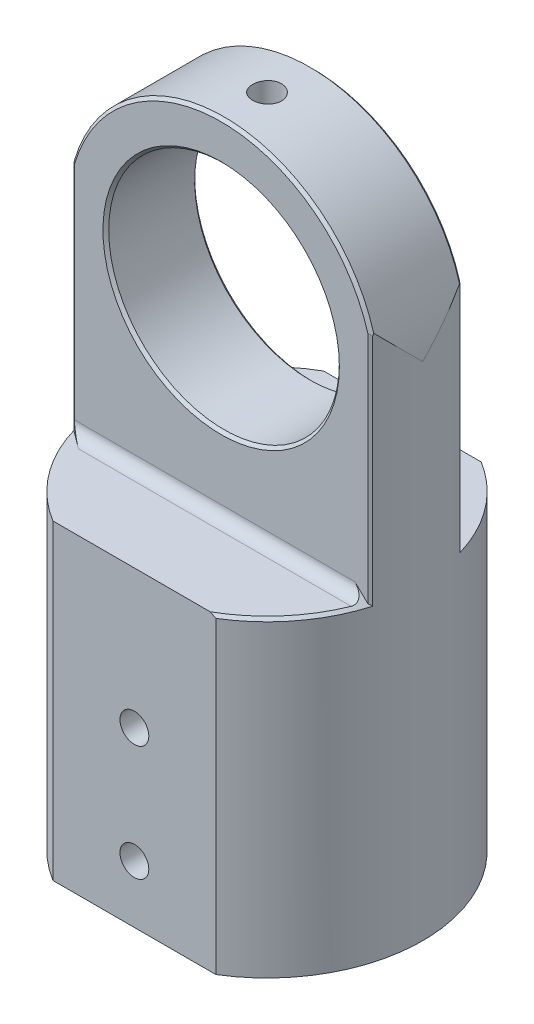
ISO-10303-21;
HEADER;
FILE_DESCRIPTION(('STEP AP214'),'2;1');
FILE_NAME('part.step','',(''),(''),'','','');
FILE_SCHEMA(('AUTOMOTIVE_DESIGN { 1 0 10303 214 1 1 1 1 }'));
ENDSEC;
DATA;
#1=APPLICATION_CONTEXT('core data for automotive mechanical design processes');
#2=APPLICATION_PROTOCOL_DEFINITION('international standard','automotive_design',2000,#1);
#3=PRODUCT_CONTEXT('',#1,'mechanical');
#4=PRODUCT('Part','Part','',(#3));
#5=PRODUCT_RELATED_PRODUCT_CATEGORY('part','',(#4));
#6=PRODUCT_DEFINITION_FORMATION('','',#4);
#7=PRODUCT_DEFINITION_CONTEXT('part definition',#1,'design');
#8=PRODUCT_DEFINITION('design','',#6,#7);
#9=PRODUCT_DEFINITION_SHAPE('','',#8);
#10=(LENGTH_UNIT() NAMED_UNIT(*) SI_UNIT(.MILLI.,.METRE.));
#11=(NAMED_UNIT(*) PLANE_ANGLE_UNIT() SI_UNIT($,.RADIAN.));
#12=(NAMED_UNIT(*) SI_UNIT($,.STERADIAN.) SOLID_ANGLE_UNIT());
#13=UNCERTAINTY_MEASURE_WITH_UNIT(LENGTH_MEASURE(1.E-05),#10,'distance_accuracy_value','');
#14=(GEOMETRIC_REPRESENTATION_CONTEXT(3) GLOBAL_UNCERTAINTY_ASSIGNED_CONTEXT((#13)) GLOBAL_UNIT_ASSIGNED_CONTEXT((#10,
#11,#12)) REPRESENTATION_CONTEXT('',''));
#15=CARTESIAN_POINT('',(0.,0.,0.));
#16=DIRECTION('',(0.,0.,1.));
#17=DIRECTION('',(1.,0.,0.));
#18=AXIS2_PLACEMENT_3D('',#15,#16,#17);
#19=CARTESIAN_POINT('',(0.,120.,0.));
#20=DIRECTION('',(0.,-1.,0.));
#21=DIRECTION('',(0.,0.,-1.));
#22=AXIS2_PLACEMENT_3D('',#19,#20,#21);
#23=CYLINDRICAL_SURFACE('',#22,27.);
#24=CARTESIAN_POINT('',(0.,87.,0.));
#25=DIRECTION('',(0.,-0.707106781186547,-0.707106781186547));
#26=DIRECTION('',(0.,-0.707106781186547,0.707106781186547));
#27=AXIS2_PLACEMENT_3D('',#24,#25,#26);
#28=ELLIPSE('',#27,38.1837661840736,27.);
#29=CARTESIAN_POINT('',(-27.,87.,0.));
#30=VERTEX_POINT('',#29);
#31=CARTESIAN_POINT('',(-25.9518303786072,94.45,-7.44999999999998));
#32=VERTEX_POINT('',#31);
#33=EDGE_CURVE('E513',#30,#32,#28,.T.);
#34=ORIENTED_EDGE('',*,*,#33,.T.);
#35=CARTESIAN_POINT('',(-25.9518303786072,94.45,-7.44999999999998));
#36=CARTESIAN_POINT('',(-25.9449944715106,94.3875324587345,-7.47380893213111));
#37=CARTESIAN_POINT('',(-25.9381794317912,94.32499132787,-7.49742723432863));
#38=CARTESIAN_POINT('',(-25.9245910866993,94.1997618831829,-7.54428258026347));
#39=CARTESIAN_POINT('',(-25.9178177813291,94.1370735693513,-7.56751962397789));
#40=CARTESIAN_POINT('',(-25.9110653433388,94.074311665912,-7.59056603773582));
#41=B_SPLINE_CURVE_WITH_KNOTS('',3,(#35,#36,#37,#38,#39,#40),.UNSPECIFIED.,.F.,.F.,(4,2,4),(0.,
0.201596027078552,0.403192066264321),.UNSPECIFIED.);
#42=CARTESIAN_POINT('',(-25.9110653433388,94.074311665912,-7.59056603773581));
#43=VERTEX_POINT('',#42);
#44=EDGE_CURVE('E612',#32,#43,#41,.T.);
#45=ORIENTED_EDGE('',*,*,#44,.T.);
#46=DIRECTION('',(0.,-1.,0.));
#47=VECTOR('',#46,1.);
#48=CARTESIAN_POINT('',(-25.9110653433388,120.,-7.59056603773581));
#49=LINE('',#48,#47);
#50=CARTESIAN_POINT('',(-25.9110653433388,53.5,-7.59056603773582));
#51=VERTEX_POINT('',#50);
#52=EDGE_CURVE('E661',#43,#51,#49,.T.);
#53=ORIENTED_EDGE('',*,*,#52,.T.);
#54=CARTESIAN_POINT('',(0.,53.5,0.));
#55=DIRECTION('',(0.,-1.,0.));
#56=DIRECTION('',(0.,0.,-1.));
#57=AXIS2_PLACEMENT_3D('',#54,#55,#56);
#58=CIRCLE('',#57,27.);
#59=CARTESIAN_POINT('',(-14.142135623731,53.5,-23.));
#60=VERTEX_POINT('',#59);
#61=EDGE_CURVE('E662',#51,#60,#58,.T.);
#62=ORIENTED_EDGE('',*,*,#61,.T.);
#63=DIRECTION('',(0.,-1.,0.));
#64=VECTOR('',#63,1.);
#65=CARTESIAN_POINT('',(-14.142135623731,120.,-23.));
#66=LINE('',#65,#64);
#67=CARTESIAN_POINT('',(-14.142135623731,0.,-23.));
#68=VERTEX_POINT('',#67);
#69=EDGE_CURVE('E717',#60,#68,#66,.T.);
#70=ORIENTED_EDGE('',*,*,#69,.T.);
#71=CARTESIAN_POINT('',(0.,0.,0.));
#72=DIRECTION('',(0.,1.,0.));
#73=DIRECTION('',(0.,0.,1.));
#74=AXIS2_PLACEMENT_3D('',#71,#72,#73);
#75=CIRCLE('',#74,27.);
#76=CARTESIAN_POINT('',(-14.142135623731,0.,23.));
#77=VERTEX_POINT('',#76);
#78=EDGE_CURVE('E727',#68,#77,#75,.T.);
#79=ORIENTED_EDGE('',*,*,#78,.T.);
#80=DIRECTION('',(0.,-1.,0.));
#81=VECTOR('',#80,1.);
#82=CARTESIAN_POINT('',(-14.1421356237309,120.,23.));
#83=LINE('',#82,#81);
#84=CARTESIAN_POINT('',(-14.1421356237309,54.,23.));
#85=VERTEX_POINT('',#84);
#86=EDGE_CURVE('E873',#77,#85,#83,.F.);
#87=ORIENTED_EDGE('',*,*,#86,.T.);
#88=CARTESIAN_POINT('',(0.,54.,0.));
#89=DIRECTION('',(0.,-1.,0.));
#90=DIRECTION('',(0.,0.,-1.));
#91=AXIS2_PLACEMENT_3D('',#88,#89,#90);
#92=CIRCLE('',#91,27.);
#93=CARTESIAN_POINT('',(-25.9110653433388,54.,7.59056603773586));
#94=VERTEX_POINT('',#93);
#95=EDGE_CURVE('E740',#85,#94,#92,.T.);
#96=ORIENTED_EDGE('',*,*,#95,.T.);
#97=DIRECTION('',(0.,-1.,0.));
#98=VECTOR('',#97,1.);
#99=CARTESIAN_POINT('',(-25.9110653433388,120.,7.59056603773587));
#100=LINE('',#99,#98);
#101=CARTESIAN_POINT('',(-25.9110653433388,94.074311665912,7.59056603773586));
#102=VERTEX_POINT('',#101);
#103=EDGE_CURVE('E664',#94,#102,#100,.F.);
#104=ORIENTED_EDGE('',*,*,#103,.T.);
#105=CARTESIAN_POINT('',(-25.9110653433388,94.074311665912,7.59056603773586));
#106=CARTESIAN_POINT('',(-25.9178177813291,94.1370735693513,7.56751962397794));
#107=CARTESIAN_POINT('',(-25.9245910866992,94.1997618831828,7.54428258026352));
#108=CARTESIAN_POINT('',(-25.9381794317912,94.32499132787,7.49742723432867));
#109=CARTESIAN_POINT('',(-25.9449944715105,94.3875324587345,7.47380893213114));
#110=CARTESIAN_POINT('',(-25.9518303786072,94.45,7.45000000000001));
#111=B_SPLINE_CURVE_WITH_KNOTS('',3,(#105,#106,#107,#108,#109,#110),.UNSPECIFIED.,.F.,.F.,(4,2,
4),(0.,0.201596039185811,0.403192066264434),.UNSPECIFIED.);
#112=CARTESIAN_POINT('',(-25.9518303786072,94.45,7.45000000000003));
#113=VERTEX_POINT('',#112);
#114=EDGE_CURVE('E669',#102,#113,#111,.T.);
#115=ORIENTED_EDGE('',*,*,#114,.T.);
#116=CARTESIAN_POINT('',(0.,87.,0.));
#117=DIRECTION('',(0.,-0.707106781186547,0.707106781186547));
#118=DIRECTION('',(0.,-0.707106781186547,-0.707106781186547));
#119=AXIS2_PLACEMENT_3D('',#116,#117,#118);
#120=ELLIPSE('',#119,38.1837661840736,27.);
#121=EDGE_CURVE('E509',#113,#30,#120,.T.);
#122=ORIENTED_EDGE('',*,*,#121,.T.);
#123=EDGE_LOOP('',(#34,#45,#53,#62,#70,#79,#87,#96,#104,#115,#122));
#124=FACE_BOUND('',#123,.T.);
#125=ADVANCED_FACE('F348',(#124),#23,.T.);
#126=CARTESIAN_POINT('',(0.,54.,0.));
#127=DIRECTION('',(0.,-1.,0.));
#128=DIRECTION('',(0.,0.,-1.));
#129=AXIS2_PLACEMENT_3D('',#126,#127,#128);
#130=CIRCLE('',#129,27.);
#131=CARTESIAN_POINT('',(14.142135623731,54.,-23.));
#132=VERTEX_POINT('',#131);
#133=CARTESIAN_POINT('',(25.9110653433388,54.,-7.59056603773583));
#134=VERTEX_POINT('',#133);
#135=EDGE_CURVE('E735',#132,#134,#130,.T.);
#136=ORIENTED_EDGE('',*,*,#135,.T.);
#137=DIRECTION('',(0.,-1.,0.));
#138=VECTOR('',#137,1.);
#139=CARTESIAN_POINT('',(25.9110653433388,120.,-7.59056603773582));
#140=LINE('',#139,#138);
#141=CARTESIAN_POINT('',(25.9110653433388,94.074311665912,-7.59056603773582));
#142=VERTEX_POINT('',#141);
#143=EDGE_CURVE('E697',#134,#142,#140,.F.);
#144=ORIENTED_EDGE('',*,*,#143,.T.);
#145=CARTESIAN_POINT('',(25.9110653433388,94.074311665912,-7.59056603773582));
#146=CARTESIAN_POINT('',(25.9178177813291,94.1370735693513,-7.5675196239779));
#147=CARTESIAN_POINT('',(25.9245910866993,94.1997618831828,-7.54428258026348));
#148=CARTESIAN_POINT('',(25.9381794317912,94.32499132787,-7.49742723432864));
#149=CARTESIAN_POINT('',(25.9449944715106,94.3875324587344,-7.47380893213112));
#150=CARTESIAN_POINT('',(25.9518303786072,94.45,-7.45));
#151=B_SPLINE_CURVE_WITH_KNOTS('',3,(#145,#146,#147,#148,#149,#150),.UNSPECIFIED.,.F.,.F.,(4,2,
4),(0.,0.201596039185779,0.403192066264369),.UNSPECIFIED.);
#152=CARTESIAN_POINT('',(25.9518303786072,94.45,-7.44999999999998));
#153=VERTEX_POINT('',#152);
#154=EDGE_CURVE('E690',#142,#153,#151,.T.);
#155=ORIENTED_EDGE('',*,*,#154,.T.);
#156=CARTESIAN_POINT('',(0.,87.,0.));
#157=DIRECTION('',(0.,-0.707106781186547,-0.707106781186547));
#158=DIRECTION('',(0.,-0.707106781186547,0.707106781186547));
#159=AXIS2_PLACEMENT_3D('',#156,#157,#158);
#160=ELLIPSE('',#159,38.1837661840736,27.);
#161=CARTESIAN_POINT('',(27.,87.,0.));
#162=VERTEX_POINT('',#161);
#163=EDGE_CURVE('E511',#153,#162,#160,.T.);
#164=ORIENTED_EDGE('',*,*,#163,.T.);
#165=CARTESIAN_POINT('',(0.,87.,0.));
#166=DIRECTION('',(0.,-0.707106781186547,0.707106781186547));
#167=DIRECTION('',(0.,-0.707106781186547,-0.707106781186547));
#168=AXIS2_PLACEMENT_3D('',#165,#166,#167);
#169=ELLIPSE('',#168,38.1837661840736,27.);
#170=CARTESIAN_POINT('',(25.9518303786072,94.45,7.45000000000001));
#171=VERTEX_POINT('',#170);
#172=EDGE_CURVE('E495',#162,#171,#169,.T.);
#173=ORIENTED_EDGE('',*,*,#172,.T.);
#174=CARTESIAN_POINT('',(25.9518303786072,94.45,7.45000000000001));
#175=CARTESIAN_POINT('',(25.9449944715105,94.3875324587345,7.47380893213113));
#176=CARTESIAN_POINT('',(25.9381794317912,94.32499132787,7.49742723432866));
#177=CARTESIAN_POINT('',(25.9245910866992,94.1997618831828,7.54428258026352));
#178=CARTESIAN_POINT('',(25.9178177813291,94.1370735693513,7.56751962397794));
#179=CARTESIAN_POINT('',(25.9110653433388,94.074311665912,7.59056603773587));
#180=B_SPLINE_CURVE_WITH_KNOTS('',3,(#174,#175,#176,#177,#178,#179),.UNSPECIFIED.,.F.,.F.,(4,2,
4),(0.,0.201596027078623,0.403192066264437),.UNSPECIFIED.);
#181=CARTESIAN_POINT('',(25.9110653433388,94.074311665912,7.59056603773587));
#182=VERTEX_POINT('',#181);
#183=EDGE_CURVE('E684',#171,#182,#180,.T.);
#184=ORIENTED_EDGE('',*,*,#183,.T.);
#185=DIRECTION('',(0.,-1.,0.));
#186=VECTOR('',#185,1.);
#187=CARTESIAN_POINT('',(25.9110653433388,120.,7.59056603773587));
#188=LINE('',#187,#186);
#189=CARTESIAN_POINT('',(25.9110653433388,53.5,7.59056603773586));
#190=VERTEX_POINT('',#189);
#191=EDGE_CURVE('E691',#182,#190,#188,.T.);
#192=ORIENTED_EDGE('',*,*,#191,.T.);
#193=CARTESIAN_POINT('',(0.,53.5,0.));
#194=DIRECTION('',(0.,-1.,0.));
#195=DIRECTION('',(0.,0.,-1.));
#196=AXIS2_PLACEMENT_3D('',#193,#194,#195);
#197=CIRCLE('',#196,27.);
#198=CARTESIAN_POINT('',(14.1421356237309,53.5,23.));
#199=VERTEX_POINT('',#198);
#200=EDGE_CURVE('E741',#190,#199,#197,.T.);
#201=ORIENTED_EDGE('',*,*,#200,.T.);
#202=DIRECTION('',(0.,-1.,0.));
#203=VECTOR('',#202,1.);
#204=CARTESIAN_POINT('',(14.1421356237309,120.,23.));
#205=LINE('',#204,#203);
#206=CARTESIAN_POINT('',(14.142135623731,0.,23.));
#207=VERTEX_POINT('',#206);
#208=EDGE_CURVE('E874',#199,#207,#205,.T.);
#209=ORIENTED_EDGE('',*,*,#208,.T.);
#210=CARTESIAN_POINT('',(14.142135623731,0.,-23.));
#211=VERTEX_POINT('',#210);
#212=EDGE_CURVE('E724',#207,#211,#75,.T.);
#213=ORIENTED_EDGE('',*,*,#212,.T.);
#214=DIRECTION('',(0.,-1.,0.));
#215=VECTOR('',#214,1.);
#216=CARTESIAN_POINT('',(14.142135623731,120.,-23.));
#217=LINE('',#216,#215);
#218=EDGE_CURVE('E725',#211,#132,#217,.F.);
#219=ORIENTED_EDGE('',*,*,#218,.T.);
#220=EDGE_LOOP('',(#136,#144,#155,#164,#173,#184,#192,#201,#209,#213,#219));
#221=FACE_BOUND('',#220,.T.);
#222=ADVANCED_FACE('F350',(#221),#23,.T.);
#223=CARTESIAN_POINT('',(0.,0.,0.));
#224=DIRECTION('',(0.,1.,0.));
#225=DIRECTION('',(0.,0.,1.));
#226=AXIS2_PLACEMENT_3D('',#223,#224,#225);
#227=PLANE('',#226);
#228=CARTESIAN_POINT('',(0.,0.,0.));
#229=DIRECTION('',(0.,-1.,0.));
#230=DIRECTION('',(0.,0.,-1.));
#231=AXIS2_PLACEMENT_3D('',#228,#229,#230);
#232=CIRCLE('',#231,12.5);
#233=CARTESIAN_POINT('',(0.,0.,-12.5));
#234=VERTEX_POINT('',#233);
#235=EDGE_CURVE('E491',#234,#234,#232,.T.);
#236=ORIENTED_EDGE('',*,*,#235,.F.);
#237=EDGE_LOOP('',(#236));
#238=FACE_BOUND('',#237,.T.);
#239=ORIENTED_EDGE('',*,*,#212,.F.);
#240=DIRECTION('',(-1.,0.,0.));
#241=VECTOR('',#240,1.);
#242=CARTESIAN_POINT('',(0.,0.,23.));
#243=LINE('',#242,#241);
#244=EDGE_CURVE('E737',#207,#77,#243,.T.);
#245=ORIENTED_EDGE('',*,*,#244,.T.);
#246=ORIENTED_EDGE('',*,*,#78,.F.);
#247=DIRECTION('',(1.,0.,0.));
#248=VECTOR('',#247,1.);
#249=CARTESIAN_POINT('',(0.,0.,-23.));
#250=LINE('',#249,#248);
#251=EDGE_CURVE('E722',#68,#211,#250,.T.);
#252=ORIENTED_EDGE('',*,*,#251,.T.);
#253=EDGE_LOOP('',(#239,#245,#246,#252));
#254=FACE_BOUND('',#253,.T.);
#255=ADVANCED_FACE('F647',(#238,#254),#227,.F.);
#256=CARTESIAN_POINT('',(0.,120.,0.));
#257=DIRECTION('',(0.,1.,0.));
#258=DIRECTION('',(0.,0.,1.));
#259=AXIS2_PLACEMENT_3D('',#256,#257,#258);
#260=CYLINDRICAL_SURFACE('',#259,2.5);
#261=CARTESIAN_POINT('',(0.,114.,2.5));
#262=CARTESIAN_POINT('',(0.140104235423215,113.999998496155,2.49999390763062));
#263=CARTESIAN_POINT('',(0.280302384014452,113.998897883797,2.48818284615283));
#264=CARTESIAN_POINT('',(0.556815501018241,113.994613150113,2.44124244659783));
#265=CARTESIAN_POINT('',(0.693125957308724,113.991426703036,2.40608707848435));
#266=CARTESIAN_POINT('',(0.957819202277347,113.983330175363,2.31348706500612));
#267=CARTESIAN_POINT('',(1.08620658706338,113.978421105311,2.2560554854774));
#268=CARTESIAN_POINT('',(1.33148991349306,113.967429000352,2.12055777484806));
#269=CARTESIAN_POINT('',(1.44838821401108,113.96134620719,2.0424958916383));
#270=CARTESIAN_POINT('',(1.66776778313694,113.94866744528,1.86769233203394));
#271=CARTESIAN_POINT('',(1.77020835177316,113.942070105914,1.77089967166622));
#272=CARTESIAN_POINT('',(1.95741499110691,113.929117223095,1.5614904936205));
#273=CARTESIAN_POINT('',(2.04218026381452,113.922761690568,1.44887326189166));
#274=CARTESIAN_POINT('',(2.19177159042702,113.910997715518,1.21076050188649));
#275=CARTESIAN_POINT('',(2.2565612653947,113.905591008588,1.08524202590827));
#276=CARTESIAN_POINT('',(2.36412993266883,113.89635331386,0.825049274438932));
#277=CARTESIAN_POINT('',(2.40690939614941,113.892522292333,0.690375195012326));
#278=CARTESIAN_POINT('',(2.4691237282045,113.886881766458,0.416106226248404));
#279=CARTESIAN_POINT('',(2.48862560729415,113.885066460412,0.276526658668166));
#280=CARTESIAN_POINT('',(2.50393826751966,113.883644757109,-0.00393547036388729));
#281=CARTESIAN_POINT('',(2.49974958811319,113.884038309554,-0.144818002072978));
#282=CARTESIAN_POINT('',(2.46785533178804,113.886984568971,-0.423426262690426));
#283=CARTESIAN_POINT('',(2.44022276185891,113.889530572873,-0.561160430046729));
#284=CARTESIAN_POINT('',(2.36233862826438,113.896484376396,-0.830027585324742));
#285=CARTESIAN_POINT('',(2.31208679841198,113.900892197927,-0.961160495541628));
#286=CARTESIAN_POINT('',(2.19030948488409,113.911080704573,-1.21333433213));
#287=CARTESIAN_POINT('',(2.11875144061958,113.916863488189,-1.33435944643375));
#288=CARTESIAN_POINT('',(1.95641639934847,113.929148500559,-1.56270925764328));
#289=CARTESIAN_POINT('',(1.86563892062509,113.935650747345,-1.67003361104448));
#290=CARTESIAN_POINT('',(1.66703328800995,113.948671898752,-1.86835971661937));
#291=CARTESIAN_POINT('',(1.55914205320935,113.955190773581,-1.9592983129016));
#292=CARTESIAN_POINT('',(1.32959106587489,113.967487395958,-2.12178254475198));
#293=CARTESIAN_POINT('',(1.20793130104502,113.973265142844,-2.193328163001));
#294=CARTESIAN_POINT('',(0.954254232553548,113.983430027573,-2.31499233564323));
#295=CARTESIAN_POINT('',(0.822235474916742,113.987816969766,-2.36510787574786));
#296=CARTESIAN_POINT('',(0.551607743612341,113.994703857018,-2.4424439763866));
#297=CARTESIAN_POINT('',(0.412998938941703,113.997203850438,-2.46966512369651));
#298=CARTESIAN_POINT('',(0.133672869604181,114.000028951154,-2.50036004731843));
#299=CARTESIAN_POINT('',(-0.00703473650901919,114.000362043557,-2.50392101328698));
#300=CARTESIAN_POINT('',(-0.287044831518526,113.998837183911,-2.48742321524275));
#301=CARTESIAN_POINT('',(-0.42634733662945,113.996979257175,-2.46736472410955));
#302=CARTESIAN_POINT('',(-0.699342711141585,113.991286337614,-2.40426970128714));
#303=CARTESIAN_POINT('',(-0.833045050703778,113.987454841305,-2.36127380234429));
#304=CARTESIAN_POINT('',(-1.09133866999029,113.978244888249,-2.2535660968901));
#305=CARTESIAN_POINT('',(-1.21592977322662,113.972866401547,-2.18885386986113));
#306=CARTESIAN_POINT('',(-1.45285965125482,113.961144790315,-2.03933287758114));
#307=CARTESIAN_POINT('',(-1.56516199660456,113.954798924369,-1.95446660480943));
#308=CARTESIAN_POINT('',(-1.77395822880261,113.941864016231,-1.7671293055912));
#309=CARTESIAN_POINT('',(-1.8704517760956,113.93527496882,-1.66465790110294));
#310=CARTESIAN_POINT('',(-2.04519234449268,113.922572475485,-1.44463965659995));
#311=CARTESIAN_POINT('',(-2.12338229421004,113.916460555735,-1.32704738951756));
#312=CARTESIAN_POINT('',(-2.25890428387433,113.905426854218,-1.08035044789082));
#313=CARTESIAN_POINT('',(-2.31623657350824,113.900505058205,-0.951245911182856));
#314=CARTESIAN_POINT('',(-2.4083194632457,113.892417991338,-0.685387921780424));
#315=CARTESIAN_POINT('',(-2.44310447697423,113.88925004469,-0.548646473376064));
#316=CARTESIAN_POINT('',(-2.4892172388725,113.88502077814,-0.271233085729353));
#317=CARTESIAN_POINT('',(-2.50054555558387,113.883959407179,-0.130561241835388));
#318=CARTESIAN_POINT('',(-2.49941608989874,113.884064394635,0.150152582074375));
#319=CARTESIAN_POINT('',(-2.48704796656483,113.88522235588,0.290194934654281));
#320=CARTESIAN_POINT('',(-2.43906421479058,113.889617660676,0.566203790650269));
#321=CARTESIAN_POINT('',(-2.40344855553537,113.892855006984,0.702170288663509));
#322=CARTESIAN_POINT('',(-2.31000454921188,113.901042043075,0.966170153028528));
#323=CARTESIAN_POINT('',(-2.25217837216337,113.90599156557,1.09420429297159));
#324=CARTESIAN_POINT('',(-2.11596435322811,113.917045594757,1.3387628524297));
#325=CARTESIAN_POINT('',(-2.03757672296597,113.923150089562,1.455287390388));
#326=CARTESIAN_POINT('',(-1.86212786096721,113.935853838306,1.67397840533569));
#327=CARTESIAN_POINT('',(-1.76499995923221,113.942454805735,1.77609129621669));
#328=CARTESIAN_POINT('',(-1.5549555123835,113.955392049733,1.96261110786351));
#329=CARTESIAN_POINT('',(-1.44203517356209,113.961728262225,2.04701376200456));
#330=CARTESIAN_POINT('',(-1.20334437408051,113.973436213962,2.19585875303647));
#331=CARTESIAN_POINT('',(-1.07754609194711,113.978805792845,2.26025660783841));
#332=CARTESIAN_POINT('',(-0.816955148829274,113.987951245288,2.36693099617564));
#333=CARTESIAN_POINT('',(-0.68217291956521,113.991728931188,2.40923269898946));
#334=CARTESIAN_POINT('',(-0.455510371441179,113.996306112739,2.45986050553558));
#335=CARTESIAN_POINT('',(-0.365083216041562,113.997684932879,2.47489251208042));
#336=CARTESIAN_POINT('',(-0.183117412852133,113.999532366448,2.49496423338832));
#337=CARTESIAN_POINT('',(-0.0915787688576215,114.000000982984,2.50000398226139));
#338=CARTESIAN_POINT('',(0.,114.,2.5));
#339=B_SPLINE_CURVE_WITH_KNOTS('',3,(#261,#262,#263,#264,#265,#266,#267,#268,#269,#270,#271,
#272,#273,#274,#275,#276,#277,#278,#279,#280,#281,#282,#283,#284,#285,#286,#287,#288,#289,#290,
#291,#292,#293,#294,#295,#296,#297,#298,#299,#300,#301,#302,#303,#304,#305,#306,#307,#308,#309,
#310,#311,#312,#313,#314,#315,#316,#317,#318,#319,#320,#321,#322,#323,#324,#325,#326,#327,#328,
#329,#330,#331,#332,#333,#334,#335,#336,#337,#338),.UNSPECIFIED.,.T.,.F.,(4,2,2,2,2,2,2,2,2,2,2,
2,2,2,2,2,2,2,2,2,2,2,2,2,2,2,2,2,2,2,2,2,2,2,2,2,2,2,4),(0.,0.41997831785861,0.840425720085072,
1.26062688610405,1.68074159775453,2.10201634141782,2.52331010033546,2.94536663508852,
3.36741413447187,3.7882437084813,4.20906369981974,4.62857799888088,5.04809723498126,
5.46826090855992,5.88843511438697,6.3101956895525,6.73195664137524,7.15377689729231,
7.57558634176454,7.99584051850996,8.41608984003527,8.8355971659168,9.25511261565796,
9.67583980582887,10.0965760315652,10.5186071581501,10.9406332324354,11.3620136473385,
11.7833838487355,12.203162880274,12.6229424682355,13.0426810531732,13.4624153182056,
13.8836713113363,14.3050286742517,14.7273163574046,15.1491219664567,15.4236406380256,
15.6981583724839),.UNSPECIFIED.);
#340=CARTESIAN_POINT('',(0.,114.,2.5));
#341=VERTEX_POINT('',#340);
#342=EDGE_CURVE('E516',#341,#341,#339,.T.);
#343=ORIENTED_EDGE('',*,*,#342,.T.);
#344=EDGE_LOOP('',(#343));
#345=FACE_BOUND('',#344,.T.);
#346=CARTESIAN_POINT('',(0.,107.,2.5));
#347=CARTESIAN_POINT('',(-0.139841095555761,106.999998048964,2.49999405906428));
#348=CARTESIAN_POINT('',(-0.279769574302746,106.998517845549,2.48822712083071));
#349=CARTESIAN_POINT('',(-0.555732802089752,106.992755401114,2.4414722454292));
#350=CARTESIAN_POINT('',(-0.691763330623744,106.988470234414,2.40646006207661));
#351=CARTESIAN_POINT('',(-0.955895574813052,106.977580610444,2.31426235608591));
#352=CARTESIAN_POINT('',(-1.08400256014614,106.970977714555,2.25709175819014));
#353=CARTESIAN_POINT('',(-1.32877947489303,106.956187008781,2.1222327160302));
#354=CARTESIAN_POINT('',(-1.44545136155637,106.947999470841,2.04454779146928));
#355=CARTESIAN_POINT('',(-1.66471281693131,106.930903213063,1.87040805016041));
#356=CARTESIAN_POINT('',(-1.76723036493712,106.921991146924,1.77386287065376));
#357=CARTESIAN_POINT('',(-1.95465279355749,106.904477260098,1.56493717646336));
#358=CARTESIAN_POINT('',(-2.03955677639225,106.895875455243,1.45255585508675));
#359=CARTESIAN_POINT('',(-2.18961016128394,106.879923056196,1.21468002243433));
#360=CARTESIAN_POINT('',(-2.25469209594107,106.872576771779,1.08914263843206));
#361=CARTESIAN_POINT('',(-2.36282307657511,106.860011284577,0.82881294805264));
#362=CARTESIAN_POINT('',(-2.40587295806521,106.854792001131,0.694020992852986));
#363=CARTESIAN_POINT('',(-2.46849898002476,106.847103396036,0.419755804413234));
#364=CARTESIAN_POINT('',(-2.4881967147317,106.844619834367,0.280310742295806));
#365=CARTESIAN_POINT('',(-2.50393554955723,106.842640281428,7.37365281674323E-05));
#366=CARTESIAN_POINT('',(-2.49997760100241,106.843144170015,-0.14071815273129));
#367=CARTESIAN_POINT('',(-2.4686172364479,106.847069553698,-0.41880482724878));
#368=CARTESIAN_POINT('',(-2.44134876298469,106.850474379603,-0.556114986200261));
#369=CARTESIAN_POINT('',(-2.36435038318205,106.859791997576,-0.824195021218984));
#370=CARTESIAN_POINT('',(-2.3146200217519,106.865704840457,-0.954964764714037));
#371=CARTESIAN_POINT('',(-2.19396555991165,106.879391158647,-1.20666799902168));
#372=CARTESIAN_POINT('',(-2.12298325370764,106.887169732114,-1.32757330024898));
#373=CARTESIAN_POINT('',(-1.96188146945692,106.903707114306,-1.55580669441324));
#374=CARTESIAN_POINT('',(-1.87176111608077,106.912465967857,-1.66313416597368));
#375=CARTESIAN_POINT('',(-1.67419911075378,106.930051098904,-1.86194271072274));
#376=CARTESIAN_POINT('',(-1.56664200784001,106.938877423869,-1.95330909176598));
#377=CARTESIAN_POINT('',(-1.33765716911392,106.955546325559,-2.11670888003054));
#378=CARTESIAN_POINT('',(-1.21622940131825,106.963388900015,-2.188742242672));
#379=CARTESIAN_POINT('',(-0.962861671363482,106.977211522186,-2.31143132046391));
#380=CARTESIAN_POINT('',(-0.830918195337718,106.983190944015,-2.36207985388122));
#381=CARTESIAN_POINT('',(-0.560307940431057,106.992607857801,-2.44047049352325));
#382=CARTESIAN_POINT('',(-0.421641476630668,106.996045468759,-2.46821367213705));
#383=CARTESIAN_POINT('',(-0.142513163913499,106.999975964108,-2.49985742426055));
#384=CARTESIAN_POINT('',(-0.00206949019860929,107.000488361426,-2.50391599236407));
#385=CARTESIAN_POINT('',(0.277496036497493,106.998563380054,-2.48849226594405));
#386=CARTESIAN_POINT('',(0.416617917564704,106.996126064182,-2.4690104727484));
#387=CARTESIAN_POINT('',(0.689124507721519,106.988587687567,-2.40719029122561));
#388=CARTESIAN_POINT('',(0.822526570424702,106.983495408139,-2.36492723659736));
#389=CARTESIAN_POINT('',(1.0803496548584,106.971217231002,-2.25882254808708));
#390=CARTESIAN_POINT('',(1.20477037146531,106.964031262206,-2.19498018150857));
#391=CARTESIAN_POINT('',(1.44180452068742,106.948318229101,-2.04714686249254));
#392=CARTESIAN_POINT('',(1.55435375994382,106.939784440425,-1.96305371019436));
#393=CARTESIAN_POINT('',(1.76379698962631,106.922351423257,-1.7772505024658));
#394=CARTESIAN_POINT('',(1.86069035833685,106.913452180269,-1.67553974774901));
#395=CARTESIAN_POINT('',(2.03663195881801,106.896231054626,-1.45669258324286));
#396=CARTESIAN_POINT('',(2.11557546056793,106.887912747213,-1.3394716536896));
#397=CARTESIAN_POINT('',(2.2526528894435,106.872854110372,-1.09334175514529));
#398=CARTESIAN_POINT('',(2.31078723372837,106.86611374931,-0.96443302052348));
#399=CARTESIAN_POINT('',(2.40442657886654,106.85499850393,-0.698924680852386));
#400=CARTESIAN_POINT('',(2.4399906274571,106.850617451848,-0.562346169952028));
#401=CARTESIAN_POINT('',(2.48766999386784,106.844699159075,-0.285097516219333));
#402=CARTESIAN_POINT('',(2.49978640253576,106.843161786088,-0.144427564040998));
#403=CARTESIAN_POINT('',(2.50020653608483,106.843108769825,0.135968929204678));
#404=CARTESIAN_POINT('',(2.48867479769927,106.84457224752,0.275695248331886));
#405=CARTESIAN_POINT('',(2.44247440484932,106.850311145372,0.551207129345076));
#406=CARTESIAN_POINT('',(2.40780574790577,106.854586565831,0.686992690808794));
#407=CARTESIAN_POINT('',(2.31636707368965,106.865461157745,0.950746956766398));
#408=CARTESIAN_POINT('',(2.25960498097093,106.872059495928,1.07871844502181));
#409=CARTESIAN_POINT('',(2.12560690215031,106.886837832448,1.32334665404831));
#410=CARTESIAN_POINT('',(2.04837065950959,106.895017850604,1.44000323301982));
#411=CARTESIAN_POINT('',(1.87500633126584,106.912106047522,1.65953122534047));
#412=CARTESIAN_POINT('',(1.77875562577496,106.92101872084,1.76230546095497));
#413=CARTESIAN_POINT('',(1.57035022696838,106.938528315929,1.95030682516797));
#414=CARTESIAN_POINT('',(1.45819178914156,106.947125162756,2.03552981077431));
#415=CARTESIAN_POINT('',(1.22066562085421,106.963070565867,2.18628535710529));
#416=CARTESIAN_POINT('',(1.09524927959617,106.970414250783,2.25174180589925));
#417=CARTESIAN_POINT('',(0.835182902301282,106.982976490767,2.36057124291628));
#418=CARTESIAN_POINT('',(0.700543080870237,106.988197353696,2.40396822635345));
#419=CARTESIAN_POINT('',(0.471005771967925,106.994667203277,2.4570593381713));
#420=CARTESIAN_POINT('',(0.377555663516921,106.996657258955,2.47313894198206));
#421=CARTESIAN_POINT('',(0.189417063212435,106.999324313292,2.49461124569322));
#422=CARTESIAN_POINT('',(0.0947285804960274,107.000001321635,2.5000040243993));
#423=CARTESIAN_POINT('',(0.,107.,2.5));
#424=B_SPLINE_CURVE_WITH_KNOTS('',3,(#346,#347,#348,#349,#350,#351,#352,#353,#354,#355,#356,
#357,#358,#359,#360,#361,#362,#363,#364,#365,#366,#367,#368,#369,#370,#371,#372,#373,#374,#375,
#376,#377,#378,#379,#380,#381,#382,#383,#384,#385,#386,#387,#388,#389,#390,#391,#392,#393,#394,
#395,#396,#397,#398,#399,#400,#401,#402,#403,#404,#405,#406,#407,#408,#409,#410,#411,#412,#413,
#414,#415,#416,#417,#418,#419,#420,#421,#422,#423),.UNSPECIFIED.,.T.,.F.,(4,2,2,2,2,2,2,2,2,2,2,
2,2,2,2,2,2,2,2,2,2,2,2,2,2,2,2,2,2,2,2,2,2,2,2,2,2,2,4),(0.,0.419177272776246,
0.838792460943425,1.25812550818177,1.67738665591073,2.09870813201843,2.5200510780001,
2.94281250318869,3.36555789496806,3.7860922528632,4.20660969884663,4.62472696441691,
5.0428527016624,5.46213426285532,5.88143500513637,6.30363478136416,6.72583553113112,
7.14817795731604,7.57050060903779,7.9900027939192,8.40949604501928,8.82761053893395,
9.24573923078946,9.66602402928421,10.0863255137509,10.5090197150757,10.9317054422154,
11.3532807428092,11.7748364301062,12.1934690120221,12.6121016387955,13.0305842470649,
13.4490720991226,13.8703523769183,14.2917319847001,14.7147140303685,15.1372349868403,
15.4211884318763,15.7051397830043),.UNSPECIFIED.);
#425=CARTESIAN_POINT('',(0.,107.,2.5));
#426=VERTEX_POINT('',#425);
#427=EDGE_CURVE('E523',#426,#426,#424,.T.);
#428=ORIENTED_EDGE('',*,*,#427,.T.);
#429=EDGE_LOOP('',(#428));
#430=FACE_BOUND('',#429,.T.);
#431=ADVANCED_FACE('F528',(#345,#430),#260,.F.);
#432=CARTESIAN_POINT('',(-27.,54.,-7.94999999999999));
#433=DIRECTION('',(0.,-1.,0.));
#434=DIRECTION('',(0.,0.,-1.));
#435=AXIS2_PLACEMENT_3D('',#432,#433,#434);
#436=PLANE('',#435);
#437=CARTESIAN_POINT('',(0.,54.,0.));
#438=DIRECTION('',(0.,-1.,0.));
#439=DIRECTION('',(0.,0.,-1.));
#440=AXIS2_PLACEMENT_3D('',#437,#438,#439);
#441=CIRCLE('',#440,26.5);
#442=CARTESIAN_POINT('',(-13.1624465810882,54.,-23.));
#443=VERTEX_POINT('',#442);
#444=CARTESIAN_POINT('',(-24.5610972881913,54.,-9.95));
#445=VERTEX_POINT('',#444);
#446=EDGE_CURVE('E611',#443,#445,#441,.F.);
#447=ORIENTED_EDGE('',*,*,#446,.T.);
#448=DIRECTION('',(1.,0.,0.));
#449=VECTOR('',#448,1.);
#450=CARTESIAN_POINT('',(25.4312307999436,54.,-9.95));
#451=LINE('',#450,#449);
#452=CARTESIAN_POINT('',(22.7612853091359,54.,-9.94999999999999));
#453=VERTEX_POINT('',#452);
#454=EDGE_CURVE('E781',#445,#453,#451,.T.);
#455=ORIENTED_EDGE('',*,*,#454,.T.);
#456=DIRECTION('',(0.800353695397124,0.,0.599528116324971));
#457=VECTOR('',#456,1.);
#458=CARTESIAN_POINT('',(-8.15443496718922,54.,-33.1083156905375));
#459=LINE('',#458,#457);
#460=EDGE_CURVE('E632',#453,#134,#459,.T.);
#461=ORIENTED_EDGE('',*,*,#460,.T.);
#462=ORIENTED_EDGE('',*,*,#135,.F.);
#463=DIRECTION('',(1.,0.,0.));
#464=VECTOR('',#463,1.);
#465=CARTESIAN_POINT('',(-27.,54.,-23.));
#466=LINE('',#465,#464);
#467=EDGE_CURVE('E730',#443,#132,#466,.T.);
#468=ORIENTED_EDGE('',*,*,#467,.F.);
#469=EDGE_LOOP('',(#447,#455,#461,#462,#468));
#470=FACE_BOUND('',#469,.T.);
#471=ADVANCED_FACE('F603',(#470),#436,.F.);
#472=CARTESIAN_POINT('',(-27.,120.,-7.94999999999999));
#473=DIRECTION('',(0.,0.,1.));
#474=DIRECTION('',(0.,-1.,0.));
#475=AXIS2_PLACEMENT_3D('',#472,#473,#474);
#476=PLANE('',#475);
#477=CARTESIAN_POINT('',(0.,87.,-7.94999999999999));
#478=DIRECTION('',(0.,0.,1.));
#479=DIRECTION('',(0.,-1.,0.));
#480=AXIS2_PLACEMENT_3D('',#477,#478,#479);
#481=CIRCLE('',#480,20.5);
#482=CARTESIAN_POINT('',(0.,66.5,-7.94999999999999));
#483=VERTEX_POINT('',#482);
#484=EDGE_CURVE('E814',#483,#483,#481,.T.);
#485=ORIENTED_EDGE('',*,*,#484,.T.);
#486=EDGE_LOOP('',(#485));
#487=FACE_BOUND('',#486,.T.);
#488=DIRECTION('',(0.,-1.,0.));
#489=VECTOR('',#488,1.);
#490=CARTESIAN_POINT('',(25.4312307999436,120.,-7.94999999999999));
#491=LINE('',#490,#489);
#492=CARTESIAN_POINT('',(25.4312307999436,94.45,-7.94999999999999));
#493=VERTEX_POINT('',#492);
#494=CARTESIAN_POINT('',(25.4312307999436,56.,-7.94999999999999));
#495=VERTEX_POINT('',#494);
#496=EDGE_CURVE('E858',#493,#495,#491,.T.);
#497=ORIENTED_EDGE('',*,*,#496,.T.);
#498=DIRECTION('',(1.,0.,0.));
#499=VECTOR('',#498,1.);
#500=CARTESIAN_POINT('',(-25.2793888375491,56.,-7.94999999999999));
#501=LINE('',#500,#499);
#502=CARTESIAN_POINT('',(-23.1742853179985,56.,-7.94999999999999));
#503=VERTEX_POINT('',#502);
#504=EDGE_CURVE('E818',#495,#503,#501,.F.);
#505=ORIENTED_EDGE('',*,*,#504,.T.);
#506=CARTESIAN_POINT('',(-23.1742853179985,56.,-7.94999999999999));
#507=CARTESIAN_POINT('',(-23.525867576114,55.6674370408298,-7.94999999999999));
#508=CARTESIAN_POINT('',(-23.8770569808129,55.3344590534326,-7.94999999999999));
#509=CARTESIAN_POINT('',(-24.5787309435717,54.6677627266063,-7.94999999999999));
#510=CARTESIAN_POINT('',(-24.9292155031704,54.3340443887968,-7.94999999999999));
#511=CARTESIAN_POINT('',(-25.3300092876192,53.951711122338,-7.94999999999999));
#512=CARTESIAN_POINT('',(-25.3806232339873,53.9034154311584,-7.94999999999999));
#513=CARTESIAN_POINT('',(-25.4312307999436,53.8551130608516,-7.94999999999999));
#514=B_SPLINE_CURVE_WITH_KNOTS('',3,(#506,#507,#508,#509,#510,#511,#512,#513),.UNSPECIFIED.,.F.,
.F.,(4,2,2,4),(0.,1.45185128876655,2.90369940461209,3.11357605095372),.UNSPECIFIED.);
#515=CARTESIAN_POINT('',(-25.4312307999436,53.8551130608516,-7.94999999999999));
#516=VERTEX_POINT('',#515);
#517=EDGE_CURVE('E627',#503,#516,#514,.T.);
#518=ORIENTED_EDGE('',*,*,#517,.T.);
#519=DIRECTION('',(0.,1.,0.));
#520=VECTOR('',#519,1.);
#521=CARTESIAN_POINT('',(-25.4312307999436,120.,-7.94999999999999));
#522=LINE('',#521,#520);
#523=CARTESIAN_POINT('',(-25.4312307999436,94.45,-7.94999999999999));
#524=VERTEX_POINT('',#523);
#525=EDGE_CURVE('E711',#516,#524,#522,.T.);
#526=ORIENTED_EDGE('',*,*,#525,.T.);
#527=CARTESIAN_POINT('',(0.,87.,-7.94999999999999));
#528=DIRECTION('',(0.,0.,1.));
#529=DIRECTION('',(0.,-1.,0.));
#530=AXIS2_PLACEMENT_3D('',#527,#528,#529);
#531=CIRCLE('',#530,26.5);
#532=EDGE_CURVE('E861',#524,#493,#531,.F.);
#533=ORIENTED_EDGE('',*,*,#532,.T.);
#534=EDGE_LOOP('',(#497,#505,#518,#526,#533));
#535=FACE_BOUND('',#534,.T.);
#536=ADVANCED_FACE('F601',(#487,#535),#476,.F.);
#537=CARTESIAN_POINT('',(-27.,54.,-23.));
#538=DIRECTION('',(0.,0.,1.));
#539=DIRECTION('',(0.,-1.,0.));
#540=AXIS2_PLACEMENT_3D('',#537,#538,#539);
#541=PLANE('',#540);
#542=ORIENTED_EDGE('',*,*,#69,.F.);
#543=CARTESIAN_POINT('',(-14.142135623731,53.5,-23.));
#544=CARTESIAN_POINT('',(-13.979749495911,53.5850876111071,-23.));
#545=CARTESIAN_POINT('',(-13.8169157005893,53.6692980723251,-23.));
#546=CARTESIAN_POINT('',(-13.4903526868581,53.8359647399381,-23.));
#547=CARTESIAN_POINT('',(-13.3266234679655,53.9184209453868,-23.));
#548=CARTESIAN_POINT('',(-13.1624465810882,54.,-23.));
#549=B_SPLINE_CURVE_WITH_KNOTS('',3,(#543,#544,#545,#546,#547,#548),.UNSPECIFIED.,.F.,.F.,(4,2,
4),(0.,0.549960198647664,1.09992069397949),.UNSPECIFIED.);
#550=EDGE_CURVE('E605',#60,#443,#549,.T.);
#551=ORIENTED_EDGE('',*,*,#550,.T.);
#552=ORIENTED_EDGE('',*,*,#467,.T.);
#553=ORIENTED_EDGE('',*,*,#218,.F.);
#554=ORIENTED_EDGE('',*,*,#251,.F.);
#555=EDGE_LOOP('',(#542,#551,#552,#553,#554));
#556=FACE_BOUND('',#555,.T.);
#557=ADVANCED_FACE('F597',(#556),#541,.F.);
#558=CARTESIAN_POINT('',(-27.,54.,23.));
#559=DIRECTION('',(0.,-1.,0.));
#560=DIRECTION('',(0.,0.,-1.));
#561=AXIS2_PLACEMENT_3D('',#558,#559,#560);
#562=PLANE('',#561);
#563=CARTESIAN_POINT('',(0.,54.,0.));
#564=DIRECTION('',(0.,-1.,0.));
#565=DIRECTION('',(0.,0.,-1.));
#566=AXIS2_PLACEMENT_3D('',#563,#564,#565);
#567=CIRCLE('',#566,26.5);
#568=CARTESIAN_POINT('',(13.1624465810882,54.,23.));
#569=VERTEX_POINT('',#568);
#570=CARTESIAN_POINT('',(24.5610972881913,54.,9.95000000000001));
#571=VERTEX_POINT('',#570);
#572=EDGE_CURVE('E589',#569,#571,#567,.F.);
#573=ORIENTED_EDGE('',*,*,#572,.T.);
#574=DIRECTION('',(1.,0.,0.));
#575=VECTOR('',#574,1.);
#576=CARTESIAN_POINT('',(-25.4312307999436,54.,9.95000000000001));
#577=LINE('',#576,#575);
#578=CARTESIAN_POINT('',(-22.7612853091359,54.,9.95));
#579=VERTEX_POINT('',#578);
#580=EDGE_CURVE('E827',#571,#579,#577,.F.);
#581=ORIENTED_EDGE('',*,*,#580,.T.);
#582=DIRECTION('',(-0.800353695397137,0.,-0.599528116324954));
#583=VECTOR('',#582,1.);
#584=CARTESIAN_POINT('',(-19.2146211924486,54.,12.606731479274));
#585=LINE('',#584,#583);
#586=EDGE_CURVE('E363',#579,#94,#585,.T.);
#587=ORIENTED_EDGE('',*,*,#586,.T.);
#588=ORIENTED_EDGE('',*,*,#95,.F.);
#589=DIRECTION('',(1.,0.,0.));
#590=VECTOR('',#589,1.);
#591=CARTESIAN_POINT('',(-27.,54.,23.));
#592=LINE('',#591,#590);
#593=EDGE_CURVE('E870',#85,#569,#592,.T.);
#594=ORIENTED_EDGE('',*,*,#593,.T.);
#595=EDGE_LOOP('',(#573,#581,#587,#588,#594));
#596=FACE_BOUND('',#595,.T.);
#597=ADVANCED_FACE('F547',(#596),#562,.F.);
#598=CARTESIAN_POINT('',(-27.,120.,7.95000000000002));
#599=DIRECTION('',(0.,0.,-1.));
#600=DIRECTION('',(0.,1.,0.));
#601=AXIS2_PLACEMENT_3D('',#598,#599,#600);
#602=PLANE('',#601);
#603=CARTESIAN_POINT('',(0.,87.,7.95000000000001));
#604=DIRECTION('',(0.,0.,-1.));
#605=DIRECTION('',(0.,1.,0.));
#606=AXIS2_PLACEMENT_3D('',#603,#604,#605);
#607=CIRCLE('',#606,20.5);
#608=CARTESIAN_POINT('',(0.,107.5,7.95000000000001));
#609=VERTEX_POINT('',#608);
#610=EDGE_CURVE('E559',#609,#609,#607,.T.);
#611=ORIENTED_EDGE('',*,*,#610,.T.);
#612=EDGE_LOOP('',(#611));
#613=FACE_BOUND('',#612,.T.);
#614=DIRECTION('',(0.,-1.,0.));
#615=VECTOR('',#614,1.);
#616=CARTESIAN_POINT('',(-25.4312307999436,120.,7.95000000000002));
#617=LINE('',#616,#615);
#618=CARTESIAN_POINT('',(-25.4312307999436,94.45,7.95000000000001));
#619=VERTEX_POINT('',#618);
#620=CARTESIAN_POINT('',(-25.4312307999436,56.,7.95000000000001));
#621=VERTEX_POINT('',#620);
#622=EDGE_CURVE('E590',#619,#621,#617,.T.);
#623=ORIENTED_EDGE('',*,*,#622,.T.);
#624=DIRECTION('',(1.,0.,0.));
#625=VECTOR('',#624,1.);
#626=CARTESIAN_POINT('',(25.2793888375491,56.,7.95000000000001));
#627=LINE('',#626,#625);
#628=CARTESIAN_POINT('',(23.1742853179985,56.,7.95000000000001));
#629=VERTEX_POINT('',#628);
#630=EDGE_CURVE('E822',#621,#629,#627,.T.);
#631=ORIENTED_EDGE('',*,*,#630,.T.);
#632=CARTESIAN_POINT('',(23.1742853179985,56.,7.95000000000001));
#633=CARTESIAN_POINT('',(23.525867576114,55.6674370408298,7.95000000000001));
#634=CARTESIAN_POINT('',(23.8770569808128,55.3344590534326,7.95000000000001));
#635=CARTESIAN_POINT('',(24.5787309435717,54.6677627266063,7.95000000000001));
#636=CARTESIAN_POINT('',(24.9292155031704,54.3340443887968,7.95000000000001));
#637=CARTESIAN_POINT('',(25.3300092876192,53.951711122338,7.95000000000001));
#638=CARTESIAN_POINT('',(25.3806232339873,53.9034154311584,7.95000000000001));
#639=CARTESIAN_POINT('',(25.4312307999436,53.8551130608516,7.95000000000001));
#640=B_SPLINE_CURVE_WITH_KNOTS('',3,(#632,#633,#634,#635,#636,#637,#638,#639),.UNSPECIFIED.,.F.,
.F.,(4,2,2,4),(0.,1.45185128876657,2.90369940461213,3.11357605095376),.UNSPECIFIED.);
#641=CARTESIAN_POINT('',(25.4312307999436,53.8551130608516,7.95000000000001));
#642=VERTEX_POINT('',#641);
#643=EDGE_CURVE('E551',#629,#642,#640,.T.);
#644=ORIENTED_EDGE('',*,*,#643,.T.);
#645=DIRECTION('',(0.,1.,0.));
#646=VECTOR('',#645,1.);
#647=CARTESIAN_POINT('',(25.4312307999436,120.,7.95000000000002));
#648=LINE('',#647,#646);
#649=CARTESIAN_POINT('',(25.4312307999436,94.45,7.95000000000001));
#650=VERTEX_POINT('',#649);
#651=EDGE_CURVE('E752',#642,#650,#648,.T.);
#652=ORIENTED_EDGE('',*,*,#651,.T.);
#653=CARTESIAN_POINT('',(0.,87.,7.95000000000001));
#654=DIRECTION('',(0.,0.,-1.));
#655=DIRECTION('',(0.,1.,0.));
#656=AXIS2_PLACEMENT_3D('',#653,#654,#655);
#657=CIRCLE('',#656,26.5);
#658=EDGE_CURVE('E854',#650,#619,#657,.F.);
#659=ORIENTED_EDGE('',*,*,#658,.T.);
#660=EDGE_LOOP('',(#623,#631,#644,#652,#659));
#661=FACE_BOUND('',#660,.T.);
#662=ADVANCED_FACE('F543',(#613,#661),#602,.F.);
#663=CARTESIAN_POINT('',(-27.,54.,23.));
#664=DIRECTION('',(0.,0.,-1.));
#665=DIRECTION('',(0.,1.,0.));
#666=AXIS2_PLACEMENT_3D('',#663,#664,#665);
#667=PLANE('',#666);
#668=CARTESIAN_POINT('',(0.,10.,23.));
#669=DIRECTION('',(0.,0.,1.));
#670=DIRECTION('',(1.,0.,0.));
#671=AXIS2_PLACEMENT_3D('',#668,#669,#670);
#672=CIRCLE('',#671,2.49999999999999);
#673=CARTESIAN_POINT('',(2.49999999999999,10.,23.));
#674=VERTEX_POINT('',#673);
#675=EDGE_CURVE('E764',#674,#674,#672,.T.);
#676=ORIENTED_EDGE('',*,*,#675,.F.);
#677=EDGE_LOOP('',(#676));
#678=FACE_BOUND('',#677,.T.);
#679=CARTESIAN_POINT('',(0.,30.,23.));
#680=DIRECTION('',(0.,0.,1.));
#681=DIRECTION('',(1.,0.,0.));
#682=AXIS2_PLACEMENT_3D('',#679,#680,#681);
#683=CIRCLE('',#682,2.49999999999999);
#684=CARTESIAN_POINT('',(2.49999999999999,30.,23.));
#685=VERTEX_POINT('',#684);
#686=EDGE_CURVE('E760',#685,#685,#683,.T.);
#687=ORIENTED_EDGE('',*,*,#686,.F.);
#688=EDGE_LOOP('',(#687));
#689=FACE_BOUND('',#688,.T.);
#690=ORIENTED_EDGE('',*,*,#208,.F.);
#691=CARTESIAN_POINT('',(14.1421356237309,53.5,23.));
#692=CARTESIAN_POINT('',(13.9797494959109,53.5850876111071,23.));
#693=CARTESIAN_POINT('',(13.8169157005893,53.6692980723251,23.));
#694=CARTESIAN_POINT('',(13.490352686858,53.8359647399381,23.));
#695=CARTESIAN_POINT('',(13.3266234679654,53.9184209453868,23.));
#696=CARTESIAN_POINT('',(13.1624465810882,54.,23.));
#697=B_SPLINE_CURVE_WITH_KNOTS('',3,(#691,#692,#693,#694,#695,#696),.UNSPECIFIED.,.F.,.F.,(4,2,
4),(0.,0.549960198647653,1.09992069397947),.UNSPECIFIED.);
#698=EDGE_CURVE('E583',#199,#569,#697,.T.);
#699=ORIENTED_EDGE('',*,*,#698,.T.);
#700=ORIENTED_EDGE('',*,*,#593,.F.);
#701=ORIENTED_EDGE('',*,*,#86,.F.);
#702=ORIENTED_EDGE('',*,*,#244,.F.);
#703=EDGE_LOOP('',(#690,#699,#700,#701,#702));
#704=FACE_BOUND('',#703,.T.);
#705=ADVANCED_FACE('F541',(#678,#689,#704),#667,.F.);
#706=CARTESIAN_POINT('',(0.,87.,-23.));
#707=DIRECTION('',(0.,0.,1.));
#708=DIRECTION('',(1.,0.,0.));
#709=AXIS2_PLACEMENT_3D('',#706,#707,#708);
#710=CYLINDRICAL_SURFACE('',#709,20.);
#711=CARTESIAN_POINT('',(0.,87.,7.45000000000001));
#712=DIRECTION('',(0.,0.,-1.));
#713=DIRECTION('',(-1.,0.,0.));
#714=AXIS2_PLACEMENT_3D('',#711,#712,#713);
#715=CIRCLE('',#714,20.);
#716=CARTESIAN_POINT('',(-20.,87.,7.45000000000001));
#717=VERTEX_POINT('',#716);
#718=EDGE_CURVE('E807',#717,#717,#715,.F.);
#719=ORIENTED_EDGE('',*,*,#718,.T.);
#720=EDGE_LOOP('',(#719));
#721=FACE_BOUND('',#720,.T.);
#722=CARTESIAN_POINT('',(0.,87.,-7.44999999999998));
#723=DIRECTION('',(0.,0.,1.));
#724=DIRECTION('',(1.,0.,0.));
#725=AXIS2_PLACEMENT_3D('',#722,#723,#724);
#726=CIRCLE('',#725,20.);
#727=CARTESIAN_POINT('',(20.,87.,-7.44999999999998));
#728=VERTEX_POINT('',#727);
#729=EDGE_CURVE('E810',#728,#728,#726,.F.);
#730=ORIENTED_EDGE('',*,*,#729,.T.);
#731=EDGE_LOOP('',(#730));
#732=FACE_BOUND('',#731,.T.);
#733=ORIENTED_EDGE('',*,*,#427,.F.);
#734=EDGE_LOOP('',(#733));
#735=FACE_BOUND('',#734,.T.);
#736=ADVANCED_FACE('F535',(#721,#732,#735),#710,.F.);
#737=CARTESIAN_POINT('',(0.,87.,-23.));
#738=DIRECTION('',(0.,0.,1.));
#739=DIRECTION('',(1.,0.,0.));
#740=AXIS2_PLACEMENT_3D('',#737,#738,#739);
#741=CYLINDRICAL_SURFACE('',#740,27.);
#742=ORIENTED_EDGE('',*,*,#163,.F.);
#743=CARTESIAN_POINT('',(0.,87.,-7.44999999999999));
#744=DIRECTION('',(0.,0.,1.));
#745=DIRECTION('',(1.,0.,0.));
#746=AXIS2_PLACEMENT_3D('',#743,#744,#745);
#747=CIRCLE('',#746,27.);
#748=EDGE_CURVE('E658',#153,#32,#747,.T.);
#749=ORIENTED_EDGE('',*,*,#748,.T.);
#750=ORIENTED_EDGE('',*,*,#33,.F.);
#751=ORIENTED_EDGE('',*,*,#121,.F.);
#752=CARTESIAN_POINT('',(0.,87.,7.45000000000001));
#753=DIRECTION('',(0.,0.,-1.));
#754=DIRECTION('',(-1.,0.,0.));
#755=AXIS2_PLACEMENT_3D('',#752,#753,#754);
#756=CIRCLE('',#755,27.);
#757=EDGE_CURVE('E862',#113,#171,#756,.T.);
#758=ORIENTED_EDGE('',*,*,#757,.T.);
#759=ORIENTED_EDGE('',*,*,#172,.F.);
#760=EDGE_LOOP('',(#742,#749,#750,#751,#758,#759));
#761=FACE_BOUND('',#760,.T.);
#762=ORIENTED_EDGE('',*,*,#342,.F.);
#763=EDGE_LOOP('',(#762));
#764=FACE_BOUND('',#763,.T.);
#765=ADVANCED_FACE('F531',(#761,#764),#741,.T.);
#766=CARTESIAN_POINT('',(0.,0.,0.));
#767=DIRECTION('',(0.,-1.,0.));
#768=DIRECTION('',(0.,0.,-1.));
#769=AXIS2_PLACEMENT_3D('',#766,#767,#768);
#770=CYLINDRICAL_SURFACE('',#769,12.5);
#771=CARTESIAN_POINT('',(2.49999999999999,10.,12.2474487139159));
#772=CARTESIAN_POINT('',(2.49999486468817,10.1389109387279,12.2474514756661));
#773=CARTESIAN_POINT('',(2.48838292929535,10.2778865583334,12.2498377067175));
#774=CARTESIAN_POINT('',(2.4422807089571,10.5519062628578,12.2591107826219));
#775=CARTESIAN_POINT('',(2.40777211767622,10.6869471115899,12.2660012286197));
#776=CARTESIAN_POINT('',(2.31698945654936,10.9490932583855,12.2834718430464));
#777=CARTESIAN_POINT('',(2.26073703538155,11.0762063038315,12.2940483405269));
#778=CARTESIAN_POINT('',(2.12812276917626,11.3191871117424,12.3176949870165));
#779=CARTESIAN_POINT('',(2.05176204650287,11.4350555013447,12.3307649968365));
#780=CARTESIAN_POINT('',(1.87994768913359,11.6539025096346,12.3581324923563));
#781=CARTESIAN_POINT('',(1.7842641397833,11.7566989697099,12.3724434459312));
#782=CARTESIAN_POINT('',(1.57701697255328,11.9448938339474,12.400561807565));
#783=CARTESIAN_POINT('',(1.46545224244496,12.030291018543,12.4143691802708));
#784=CARTESIAN_POINT('',(1.22840338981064,12.1819700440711,12.440069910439));
#785=CARTESIAN_POINT('',(1.10280641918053,12.2480787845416,12.4519455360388));
#786=CARTESIAN_POINT('',(0.842010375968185,12.3581873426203,12.4722934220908));
#787=CARTESIAN_POINT('',(0.706812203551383,12.4021892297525,12.480766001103));
#788=CARTESIAN_POINT('',(0.432541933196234,12.466267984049,12.4932580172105));
#789=CARTESIAN_POINT('',(0.293544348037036,12.4866524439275,12.4973346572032));
#790=CARTESIAN_POINT('',(0.014046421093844,12.5038773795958,12.5007730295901));
#791=CARTESIAN_POINT('',(-0.126453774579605,12.5007201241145,12.500135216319));
#792=CARTESIAN_POINT('',(-0.40285500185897,12.4711845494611,12.4942608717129));
#793=CARTESIAN_POINT('',(-0.538793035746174,12.4451375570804,12.4890899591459));
#794=CARTESIAN_POINT('',(-0.804329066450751,12.3710874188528,12.4748044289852));
#795=CARTESIAN_POINT('',(-0.933926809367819,12.3230833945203,12.465689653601));
#796=CARTESIAN_POINT('',(-1.18404865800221,12.2061748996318,12.444432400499));
#797=CARTESIAN_POINT('',(-1.30451043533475,12.1371406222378,12.4322712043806));
#798=CARTESIAN_POINT('',(-1.53226261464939,11.9802273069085,12.4062617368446));
#799=CARTESIAN_POINT('',(-1.6395514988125,11.8923461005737,12.3924132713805));
#800=CARTESIAN_POINT('',(-1.83987857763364,11.6984159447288,12.3642741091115));
#801=CARTESIAN_POINT('',(-1.93263579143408,11.592077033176,12.3499799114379));
#802=CARTESIAN_POINT('',(-2.09904623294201,11.3652088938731,12.322789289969));
#803=CARTESIAN_POINT('',(-2.17269909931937,11.244679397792,12.3098928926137));
#804=CARTESIAN_POINT('',(-2.2989070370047,10.9924479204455,12.2869511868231));
#805=CARTESIAN_POINT('',(-2.35141661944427,10.8607225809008,12.2769120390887));
#806=CARTESIAN_POINT('',(-2.43347585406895,10.59007169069,12.2609119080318));
#807=CARTESIAN_POINT('',(-2.4630284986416,10.4511470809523,12.2549503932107));
#808=CARTESIAN_POINT('',(-2.49791501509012,10.1725878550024,12.2478869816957));
#809=CARTESIAN_POINT('',(-2.50365464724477,10.0330060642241,12.2467036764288));
#810=CARTESIAN_POINT('',(-2.49184407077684,9.75487944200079,12.2491121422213));
#811=CARTESIAN_POINT('',(-2.4742951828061,9.61633455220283,12.2527036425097));
#812=CARTESIAN_POINT('',(-2.41675552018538,9.34557839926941,12.2641808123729));
#813=CARTESIAN_POINT('',(-2.37698155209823,9.21331914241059,12.2720249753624));
#814=CARTESIAN_POINT('',(-2.27635258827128,8.95734180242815,12.2910872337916));
#815=CARTESIAN_POINT('',(-2.21549585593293,8.8336244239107,12.3023056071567));
#816=CARTESIAN_POINT('',(-2.07351035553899,8.5964672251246,12.327035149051));
#817=CARTESIAN_POINT('',(-1.99212769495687,8.48318238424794,12.3405742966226));
#818=CARTESIAN_POINT('',(-1.81173893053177,8.27172921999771,12.3683430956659));
#819=CARTESIAN_POINT('',(-1.71273101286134,8.17356245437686,12.3825728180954));
#820=CARTESIAN_POINT('',(-1.49808068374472,7.99359360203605,12.4103836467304));
#821=CARTESIAN_POINT('',(-1.38220624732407,7.91206586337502,12.4239514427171));
#822=CARTESIAN_POINT('',(-1.13816974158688,7.76963529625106,12.4486781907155));
#823=CARTESIAN_POINT('',(-1.01000818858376,7.70873160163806,12.4598372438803));
#824=CARTESIAN_POINT('',(-0.745756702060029,7.60967782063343,12.4784323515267));
#825=CARTESIAN_POINT('',(-0.609716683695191,7.57139870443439,12.4858894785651));
#826=CARTESIAN_POINT('',(-0.332973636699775,7.5182718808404,12.4963308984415));
#827=CARTESIAN_POINT('',(-0.192271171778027,7.50342135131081,12.4993157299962));
#828=CARTESIAN_POINT('',(0.0871822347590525,7.49768254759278,12.5004635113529));
#829=CARTESIAN_POINT('',(0.225924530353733,7.50638179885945,12.4987094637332));
#830=CARTESIAN_POINT('',(0.499927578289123,7.54658487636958,12.4907510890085));
#831=CARTESIAN_POINT('',(0.635188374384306,7.57808841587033,12.4845468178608));
#832=CARTESIAN_POINT('',(0.89813187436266,7.66282248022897,12.468387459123));
#833=CARTESIAN_POINT('',(1.02583110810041,7.71600344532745,12.4584409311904));
#834=CARTESIAN_POINT('',(1.27055305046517,7.84253060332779,12.435868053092));
#835=CARTESIAN_POINT('',(1.38757491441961,7.91587838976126,12.4232414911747));
#836=CARTESIAN_POINT('',(1.60965972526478,8.08204846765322,12.3964399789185));
#837=CARTESIAN_POINT('',(1.7144992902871,8.17516584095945,12.3822433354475));
#838=CARTESIAN_POINT('',(1.90720654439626,8.37762560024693,12.3540305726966));
#839=CARTESIAN_POINT('',(1.99507020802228,8.48697182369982,12.340014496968));
#840=CARTESIAN_POINT('',(2.15223054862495,8.72019829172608,12.3135835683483));
#841=CARTESIAN_POINT('',(2.22131703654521,8.84422240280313,12.3011875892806));
#842=CARTESIAN_POINT('',(2.33756012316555,9.10233193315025,12.2796309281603));
#843=CARTESIAN_POINT('',(2.3847366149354,9.23640809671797,12.2704673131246));
#844=CARTESIAN_POINT('',(2.44667284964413,9.47565613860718,12.2582420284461));
#845=CARTESIAN_POINT('',(2.4666347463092,9.57946354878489,12.2542196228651));
#846=CARTESIAN_POINT('',(2.49330004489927,9.78883488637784,12.2488219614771));
#847=CARTESIAN_POINT('',(2.5000039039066,9.89439875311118,12.2474466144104));
#848=CARTESIAN_POINT('',(2.49999999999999,10.,12.2474487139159));
#849=B_SPLINE_CURVE_WITH_KNOTS('',3,(#771,#772,#773,#774,#775,#776,#777,#778,#779,#780,#781,
#782,#783,#784,#785,#786,#787,#788,#789,#790,#791,#792,#793,#794,#795,#796,#797,#798,#799,#800,
#801,#802,#803,#804,#805,#806,#807,#808,#809,#810,#811,#812,#813,#814,#815,#816,#817,#818,#819,
#820,#821,#822,#823,#824,#825,#826,#827,#828,#829,#830,#831,#832,#833,#834,#835,#836,#837,#838,
#839,#840,#841,#842,#843,#844,#845,#846,#847,#848),.UNSPECIFIED.,.T.,.F.,(4,2,2,2,2,2,2,2,2,2,2,
2,2,2,2,2,2,2,2,2,2,2,2,2,2,2,2,2,2,2,2,2,2,2,2,2,2,2,4),(0.,0.416346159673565,
0.833025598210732,1.24929124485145,1.66553366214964,2.0870563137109,2.50860850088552,
2.93383501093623,3.35902170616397,3.77860622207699,4.19815030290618,4.61171974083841,
5.02530572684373,5.44149810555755,5.85773839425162,6.28123366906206,6.70473695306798,
7.12914657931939,7.55350087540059,7.97059394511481,8.38766336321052,8.80073354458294,
9.21383775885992,9.632326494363,10.0508583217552,10.4758150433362,10.9007539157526,
11.3232453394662,11.7456858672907,12.1607754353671,12.5758597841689,12.9900004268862,
13.4041738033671,13.8250288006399,14.2459834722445,14.6714724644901,15.0965743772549,
15.413095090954,15.729604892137),.UNSPECIFIED.);
#850=CARTESIAN_POINT('',(2.49999999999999,10.,12.2474487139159));
#851=VERTEX_POINT('',#850);
#852=EDGE_CURVE('E763',#851,#851,#849,.T.);
#853=ORIENTED_EDGE('',*,*,#852,.T.);
#854=EDGE_LOOP('',(#853));
#855=FACE_BOUND('',#854,.T.);
#856=CARTESIAN_POINT('',(2.49999999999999,30.,12.2474487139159));
#857=CARTESIAN_POINT('',(2.49999486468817,30.1389109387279,12.2474514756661));
#858=CARTESIAN_POINT('',(2.48838292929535,30.2778865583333,12.2498377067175));
#859=CARTESIAN_POINT('',(2.4422807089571,30.5519062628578,12.2591107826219));
#860=CARTESIAN_POINT('',(2.40777211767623,30.6869471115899,12.2660012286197));
#861=CARTESIAN_POINT('',(2.31698945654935,30.9490932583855,12.2834718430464));
#862=CARTESIAN_POINT('',(2.26073703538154,31.0762063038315,12.2940483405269));
#863=CARTESIAN_POINT('',(2.12812276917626,31.3191871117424,12.3176949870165));
#864=CARTESIAN_POINT('',(2.05176204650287,31.4350555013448,12.3307649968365));
#865=CARTESIAN_POINT('',(1.87994768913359,31.6539025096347,12.3581324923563));
#866=CARTESIAN_POINT('',(1.78426413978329,31.7566989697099,12.3724434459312));
#867=CARTESIAN_POINT('',(1.57701697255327,31.9448938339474,12.400561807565));
#868=CARTESIAN_POINT('',(1.46545224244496,32.030291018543,12.4143691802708));
#869=CARTESIAN_POINT('',(1.22840338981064,32.1819700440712,12.440069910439));
#870=CARTESIAN_POINT('',(1.10280641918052,32.2480787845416,12.4519455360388));
#871=CARTESIAN_POINT('',(0.842010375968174,32.3581873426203,12.4722934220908));
#872=CARTESIAN_POINT('',(0.706812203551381,32.4021892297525,12.480766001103));
#873=CARTESIAN_POINT('',(0.432541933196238,32.4662679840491,12.4932580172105));
#874=CARTESIAN_POINT('',(0.293544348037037,32.4866524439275,12.4973346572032));
#875=CARTESIAN_POINT('',(0.0140464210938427,32.5038773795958,12.5007730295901));
#876=CARTESIAN_POINT('',(-0.126453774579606,32.5007201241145,12.500135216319));
#877=CARTESIAN_POINT('',(-0.402855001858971,32.4711845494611,12.4942608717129));
#878=CARTESIAN_POINT('',(-0.538793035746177,32.4451375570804,12.4890899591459));
#879=CARTESIAN_POINT('',(-0.804329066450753,32.3710874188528,12.4748044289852));
#880=CARTESIAN_POINT('',(-0.93392680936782,32.3230833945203,12.465689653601));
#881=CARTESIAN_POINT('',(-1.18404865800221,32.2061748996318,12.444432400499));
#882=CARTESIAN_POINT('',(-1.30451043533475,32.1371406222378,12.4322712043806));
#883=CARTESIAN_POINT('',(-1.53226261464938,31.9802273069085,12.4062617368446));
#884=CARTESIAN_POINT('',(-1.63955149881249,31.8923461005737,12.3924132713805));
#885=CARTESIAN_POINT('',(-1.83987857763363,31.6984159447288,12.3642741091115));
#886=CARTESIAN_POINT('',(-1.93263579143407,31.592077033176,12.3499799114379));
#887=CARTESIAN_POINT('',(-2.09904623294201,31.3652088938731,12.322789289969));
#888=CARTESIAN_POINT('',(-2.17269909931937,31.244679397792,12.3098928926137));
#889=CARTESIAN_POINT('',(-2.2989070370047,30.9924479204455,12.2869511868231));
#890=CARTESIAN_POINT('',(-2.35141661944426,30.8607225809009,12.2769120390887));
#891=CARTESIAN_POINT('',(-2.43347585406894,30.59007169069,12.2609119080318));
#892=CARTESIAN_POINT('',(-2.4630284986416,30.4511470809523,12.2549503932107));
#893=CARTESIAN_POINT('',(-2.49791501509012,30.1725878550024,12.2478869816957));
#894=CARTESIAN_POINT('',(-2.50365464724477,30.0330060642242,12.2467036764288));
#895=CARTESIAN_POINT('',(-2.49184407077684,29.7548794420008,12.2491121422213));
#896=CARTESIAN_POINT('',(-2.4742951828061,29.6163345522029,12.2527036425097));
#897=CARTESIAN_POINT('',(-2.41675552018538,29.3455783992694,12.2641808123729));
#898=CARTESIAN_POINT('',(-2.37698155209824,29.2133191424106,12.2720249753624));
#899=CARTESIAN_POINT('',(-2.27635258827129,28.9573418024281,12.2910872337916));
#900=CARTESIAN_POINT('',(-2.21549585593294,28.8336244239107,12.3023056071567));
#901=CARTESIAN_POINT('',(-2.07351035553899,28.5964672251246,12.327035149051));
#902=CARTESIAN_POINT('',(-1.99212769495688,28.4831823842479,12.3405742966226));
#903=CARTESIAN_POINT('',(-1.81173893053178,28.2717292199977,12.3683430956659));
#904=CARTESIAN_POINT('',(-1.71273101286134,28.1735624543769,12.3825728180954));
#905=CARTESIAN_POINT('',(-1.49808068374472,27.9935936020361,12.4103836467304));
#906=CARTESIAN_POINT('',(-1.38220624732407,27.912065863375,12.4239514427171));
#907=CARTESIAN_POINT('',(-1.13816974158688,27.769635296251,12.4486781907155));
#908=CARTESIAN_POINT('',(-1.01000818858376,27.708731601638,12.4598372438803));
#909=CARTESIAN_POINT('',(-0.74575670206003,27.6096778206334,12.4784323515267));
#910=CARTESIAN_POINT('',(-0.609716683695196,27.5713987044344,12.4858894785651));
#911=CARTESIAN_POINT('',(-0.33297363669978,27.5182718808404,12.4963308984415));
#912=CARTESIAN_POINT('',(-0.192271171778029,27.5034213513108,12.4993157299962));
#913=CARTESIAN_POINT('',(0.0871822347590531,27.4976825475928,12.5004635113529));
#914=CARTESIAN_POINT('',(0.225924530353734,27.5063817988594,12.4987094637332));
#915=CARTESIAN_POINT('',(0.499927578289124,27.5465848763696,12.4907510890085));
#916=CARTESIAN_POINT('',(0.635188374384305,27.5780884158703,12.4845468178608));
#917=CARTESIAN_POINT('',(0.898131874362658,27.662822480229,12.468387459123));
#918=CARTESIAN_POINT('',(1.0258311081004,27.7160034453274,12.4584409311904));
#919=CARTESIAN_POINT('',(1.27055305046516,27.8425306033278,12.435868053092));
#920=CARTESIAN_POINT('',(1.38757491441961,27.9158783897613,12.4232414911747));
#921=CARTESIAN_POINT('',(1.60965972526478,28.0820484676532,12.3964399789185));
#922=CARTESIAN_POINT('',(1.7144992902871,28.1751658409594,12.3822433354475));
#923=CARTESIAN_POINT('',(1.90720654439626,28.3776256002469,12.3540305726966));
#924=CARTESIAN_POINT('',(1.99507020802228,28.4869718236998,12.340014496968));
#925=CARTESIAN_POINT('',(2.15223054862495,28.7201982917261,12.3135835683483));
#926=CARTESIAN_POINT('',(2.22131703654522,28.8442224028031,12.3011875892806));
#927=CARTESIAN_POINT('',(2.33756012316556,29.1023319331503,12.2796309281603));
#928=CARTESIAN_POINT('',(2.3847366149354,29.236408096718,12.2704673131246));
#929=CARTESIAN_POINT('',(2.44667284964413,29.4756561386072,12.2582420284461));
#930=CARTESIAN_POINT('',(2.4666347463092,29.5794635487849,12.2542196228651));
#931=CARTESIAN_POINT('',(2.49330004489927,29.7888348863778,12.2488219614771));
#932=CARTESIAN_POINT('',(2.5000039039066,29.8943987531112,12.2474466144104));
#933=CARTESIAN_POINT('',(2.49999999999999,30.,12.2474487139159));
#934=B_SPLINE_CURVE_WITH_KNOTS('',3,(#856,#857,#858,#859,#860,#861,#862,#863,#864,#865,#866,
#867,#868,#869,#870,#871,#872,#873,#874,#875,#876,#877,#878,#879,#880,#881,#882,#883,#884,#885,
#886,#887,#888,#889,#890,#891,#892,#893,#894,#895,#896,#897,#898,#899,#900,#901,#902,#903,#904,
#905,#906,#907,#908,#909,#910,#911,#912,#913,#914,#915,#916,#917,#918,#919,#920,#921,#922,#923,
#924,#925,#926,#927,#928,#929,#930,#931,#932,#933),.UNSPECIFIED.,.T.,.F.,(4,2,2,2,2,2,2,2,2,2,2,
2,2,2,2,2,2,2,2,2,2,2,2,2,2,2,2,2,2,2,2,2,2,2,2,2,2,2,4),(0.,0.416346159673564,
0.833025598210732,1.24929124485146,1.66553366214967,2.08705631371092,2.50860850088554,
2.93383501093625,3.35902170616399,3.778606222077,4.1981503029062,4.61171974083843,
5.02530572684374,5.44149810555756,5.85773839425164,6.28123366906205,6.70473695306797,
7.12914657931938,7.55350087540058,7.9705939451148,8.3876633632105,8.80073354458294,
9.21383775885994,9.632326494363,10.0508583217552,10.4758150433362,10.9007539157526,
11.3232453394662,11.7456858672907,12.1607754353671,12.5758597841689,12.9900004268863,
13.4041738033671,13.8250288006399,14.2459834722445,14.6714724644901,15.0965743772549,
15.413095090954,15.729604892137),.UNSPECIFIED.);
#935=CARTESIAN_POINT('',(2.49999999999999,30.,12.2474487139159));
#936=VERTEX_POINT('',#935);
#937=EDGE_CURVE('E757',#936,#936,#934,.T.);
#938=ORIENTED_EDGE('',*,*,#937,.T.);
#939=EDGE_LOOP('',(#938));
#940=FACE_BOUND('',#939,.T.);
#941=CARTESIAN_POINT('',(0.,50.,0.));
#942=DIRECTION('',(0.,-1.,0.));
#943=DIRECTION('',(0.,0.,-1.));
#944=AXIS2_PLACEMENT_3D('',#941,#942,#943);
#945=CIRCLE('',#944,12.5);
#946=CARTESIAN_POINT('',(0.,50.,-12.5));
#947=VERTEX_POINT('',#946);
#948=EDGE_CURVE('E489',#947,#947,#945,.T.);
#949=ORIENTED_EDGE('',*,*,#948,.F.);
#950=EDGE_LOOP('',(#949));
#951=FACE_BOUND('',#950,.T.);
#952=ORIENTED_EDGE('',*,*,#235,.T.);
#953=EDGE_LOOP('',(#952));
#954=FACE_BOUND('',#953,.T.);
#955=ADVANCED_FACE('F485',(#855,#940,#951,#954),#770,.F.);
#956=CARTESIAN_POINT('',(0.,50.,0.));
#957=DIRECTION('',(0.,-1.,0.));
#958=DIRECTION('',(0.,0.,-1.));
#959=AXIS2_PLACEMENT_3D('',#956,#957,#958);
#960=CONICAL_SURFACE('',#959,12.5,1.02974425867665);
#961=CARTESIAN_POINT('',(0.,57.5107577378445,0.));
#962=VERTEX_POINT('',#961);
#963=VERTEX_LOOP('',#962);
#964=FACE_BOUND('',#963,.T.);
#965=ORIENTED_EDGE('',*,*,#948,.T.);
#966=EDGE_LOOP('',(#965));
#967=FACE_BOUND('',#966,.T.);
#968=ADVANCED_FACE('F481',(#964,#967),#960,.F.);
#969=CARTESIAN_POINT('',(0.,53.5,0.));
#970=DIRECTION('',(0.,-1.,0.));
#971=DIRECTION('',(0.,0.,-1.));
#972=AXIS2_PLACEMENT_3D('',#969,#970,#971);
#973=CONICAL_SURFACE('',#972,27.,0.785398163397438);
#974=ORIENTED_EDGE('',*,*,#550,.F.);
#975=ORIENTED_EDGE('',*,*,#61,.F.);
#976=CARTESIAN_POINT('',(-25.9110653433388,53.5,-7.59056603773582));
#977=CARTESIAN_POINT('',(-25.8313473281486,53.5597221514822,-7.65028112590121));
#978=CARTESIAN_POINT('',(-25.7515021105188,53.6191759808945,-7.7100914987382));
#979=CARTESIAN_POINT('',(-25.5915572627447,53.7375470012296,-7.82990281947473));
#980=CARTESIAN_POINT('',(-25.5114576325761,53.7964641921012,-7.88990376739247));
#981=CARTESIAN_POINT('',(-25.4312307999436,53.8551130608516,-7.94999999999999));
#982=B_SPLINE_CURVE_WITH_KNOTS('',3,(#976,#977,#978,#979,#980,#981),.UNSPECIFIED.,.F.,.F.,(4,2,
4),(0.,0.348404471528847,0.696808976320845),.UNSPECIFIED.);
#983=EDGE_CURVE('E492',#516,#51,#982,.F.);
#984=ORIENTED_EDGE('',*,*,#983,.F.);
#985=ORIENTED_EDGE('',*,*,#517,.F.);
#986=CARTESIAN_POINT('',(-23.1742853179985,56.,-7.94999999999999));
#987=CARTESIAN_POINT('',(-23.2351771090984,55.9423983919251,-7.95001000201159));
#988=CARTESIAN_POINT('',(-23.295672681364,55.8843491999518,-7.95248949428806));
#989=CARTESIAN_POINT('',(-23.4156383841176,55.7675047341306,-7.96269001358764));
#990=CARTESIAN_POINT('',(-23.4751070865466,55.7087085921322,-7.9704178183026));
#991=CARTESIAN_POINT('',(-23.5932459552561,55.5900477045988,-7.9915296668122));
#992=CARTESIAN_POINT('',(-23.6519011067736,55.5301782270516,-8.00497244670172));
#993=CARTESIAN_POINT('',(-23.7672951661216,55.4103187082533,-8.03789736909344));
#994=CARTESIAN_POINT('',(-23.8240350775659,55.3503287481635,-8.05737629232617));
#995=CARTESIAN_POINT('',(-23.9630376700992,55.2004303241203,-8.1142534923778));
#996=CARTESIAN_POINT('',(-24.0438073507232,55.1106269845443,-8.15573816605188));
#997=CARTESIAN_POINT('',(-24.1971650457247,54.9334452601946,-8.25508617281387));
#998=CARTESIAN_POINT('',(-24.2697791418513,54.8460598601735,-8.31289508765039));
#999=CARTESIAN_POINT('',(-24.3874712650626,54.6963127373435,-8.43104443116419));
#1000=CARTESIAN_POINT('',(-24.4350065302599,54.6329051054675,-8.48758120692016));
#1001=CARTESIAN_POINT('',(-24.5207381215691,54.5109457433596,-8.61198809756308));
#1002=CARTESIAN_POINT('',(-24.5589434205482,54.4523893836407,-8.67984721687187));
#1003=CARTESIAN_POINT('',(-24.6166859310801,54.3536600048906,-8.81203951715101));
#1004=CARTESIAN_POINT('',(-24.6384233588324,54.312145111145,-8.87439895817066));
#1005=CARTESIAN_POINT('',(-24.6724315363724,54.2355504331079,-9.00530552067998));
#1006=CARTESIAN_POINT('',(-24.6847157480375,54.2004615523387,-9.07384368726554));
#1007=CARTESIAN_POINT('',(-24.6987291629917,54.1380303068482,-9.21576561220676));
#1008=CARTESIAN_POINT('',(-24.7004137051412,54.1107211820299,-9.2891685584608));
#1009=CARTESIAN_POINT('',(-24.6927775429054,54.0650002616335,-9.43827289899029));
#1010=CARTESIAN_POINT('',(-24.6834399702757,54.0466021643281,-9.51397764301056));
#1011=CARTESIAN_POINT('',(-24.6571999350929,54.0215575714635,-9.65060364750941));
#1012=CARTESIAN_POINT('',(-24.6420720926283,54.0133423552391,-9.71160057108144));
#1013=CARTESIAN_POINT('',(-24.6058552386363,54.0025571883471,-9.83210824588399));
#1014=CARTESIAN_POINT('',(-24.5847856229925,53.9999691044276,-9.89162315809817));
#1015=CARTESIAN_POINT('',(-24.5610972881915,53.9999999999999,-9.95));
#1016=B_SPLINE_CURVE_WITH_KNOTS('',3,(#986,#987,#988,#989,#990,#991,#992,#993,#994,#995,#996,
#997,#998,#999,#1000,#1001,#1002,#1003,#1004,#1005,#1006,#1007,#1008,#1009,#1010,#1011,#1012,
#1013,#1014,#1015),.UNSPECIFIED.,.F.,.F.,(4,2,2,2,2,2,2,2,2,2,2,2,2,2,4),(0.,0.251449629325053,
0.503224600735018,0.757652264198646,1.01194446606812,1.3939458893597,1.77468861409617,
2.06574871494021,2.35652778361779,2.58958923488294,2.82231817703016,3.05602705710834,
3.29009406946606,3.4796840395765,3.66866215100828),.UNSPECIFIED.);
#1017=EDGE_CURVE('E832',#503,#445,#1016,.T.);
#1018=ORIENTED_EDGE('',*,*,#1017,.T.);
#1019=ORIENTED_EDGE('',*,*,#446,.F.);
#1020=EDGE_LOOP('',(#974,#975,#984,#985,#1018,#1019));
#1021=FACE_BOUND('',#1020,.T.);
#1022=ADVANCED_FACE('F484',(#1021),#973,.T.);
#1023=CARTESIAN_POINT('',(-25.9110653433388,120.,-7.59056603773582));
#1024=DIRECTION('',(0.599528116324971,0.,0.800353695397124));
#1025=DIRECTION('',(0.800353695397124,0.,-0.599528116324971));
#1026=AXIS2_PLACEMENT_3D('',#1023,#1024,#1025);
#1027=PLANE('',#1026);
#1028=ORIENTED_EDGE('',*,*,#983,.T.);
#1029=ORIENTED_EDGE('',*,*,#52,.F.);
#1030=CARTESIAN_POINT('',(-12.7156153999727,87.,-17.4749999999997));
#1031=DIRECTION('',(0.599528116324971,0.,0.800353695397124));
#1032=DIRECTION('',(-0.800353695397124,0.,0.599528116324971));
#1033=AXIS2_PLACEMENT_3D('',#1030,#1031,#1032);
#1034=ELLIPSE('',#1033,21.2093729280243,11.2456102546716);
#1035=EDGE_CURVE('E498',#524,#43,#1034,.T.);
#1036=ORIENTED_EDGE('',*,*,#1035,.F.);
#1037=ORIENTED_EDGE('',*,*,#525,.F.);
#1038=EDGE_LOOP('',(#1028,#1029,#1036,#1037));
#1039=FACE_BOUND('',#1038,.T.);
#1040=ADVANCED_FACE('F620',(#1039),#1027,.F.);
#1041=CARTESIAN_POINT('',(0.,87.,-7.94999999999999));
#1042=DIRECTION('',(0.,0.,1.));
#1043=DIRECTION('',(1.,0.,0.));
#1044=AXIS2_PLACEMENT_3D('',#1041,#1042,#1043);
#1045=CONICAL_SURFACE('',#1044,26.5,0.785398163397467);
#1046=ORIENTED_EDGE('',*,*,#748,.F.);
#1047=ORIENTED_EDGE('',*,*,#154,.F.);
#1048=CARTESIAN_POINT('',(12.7156153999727,87.,-17.4749999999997));
#1049=DIRECTION('',(0.599528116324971,0.,-0.800353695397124));
#1050=DIRECTION('',(0.800353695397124,0.,0.599528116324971));
#1051=AXIS2_PLACEMENT_3D('',#1048,#1049,#1050);
#1052=ELLIPSE('',#1051,21.2093729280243,11.2456102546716);
#1053=EDGE_CURVE('E753',#493,#142,#1052,.T.);
#1054=ORIENTED_EDGE('',*,*,#1053,.F.);
#1055=ORIENTED_EDGE('',*,*,#532,.F.);
#1056=ORIENTED_EDGE('',*,*,#1035,.T.);
#1057=ORIENTED_EDGE('',*,*,#44,.F.);
#1058=EDGE_LOOP('',(#1046,#1047,#1054,#1055,#1056,#1057));
#1059=FACE_BOUND('',#1058,.T.);
#1060=ADVANCED_FACE('F656',(#1059),#1045,.T.);
#1061=CARTESIAN_POINT('',(25.9110653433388,120.,-7.59056603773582));
#1062=DIRECTION('',(0.599528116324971,0.,-0.800353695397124));
#1063=DIRECTION('',(-0.800353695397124,0.,-0.599528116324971));
#1064=AXIS2_PLACEMENT_3D('',#1061,#1062,#1063);
#1065=PLANE('',#1064);
#1066=ORIENTED_EDGE('',*,*,#460,.F.);
#1067=CARTESIAN_POINT('',(22.761285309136,56.,-9.95));
#1068=DIRECTION('',(0.599528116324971,0.,-0.800353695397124));
#1069=DIRECTION('',(-0.800353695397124,0.,-0.599528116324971));
#1070=AXIS2_PLACEMENT_3D('',#1067,#1068,#1069);
#1071=ELLIPSE('',#1070,3.33595697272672,2.);
#1072=EDGE_CURVE('E831',#453,#495,#1071,.F.);
#1073=ORIENTED_EDGE('',*,*,#1072,.T.);
#1074=ORIENTED_EDGE('',*,*,#496,.F.);
#1075=ORIENTED_EDGE('',*,*,#1053,.T.);
#1076=ORIENTED_EDGE('',*,*,#143,.F.);
#1077=EDGE_LOOP('',(#1066,#1073,#1074,#1075,#1076));
#1078=FACE_BOUND('',#1077,.T.);
#1079=ADVANCED_FACE('F568',(#1078),#1065,.T.);
#1080=CARTESIAN_POINT('',(0.,53.5,0.));
#1081=DIRECTION('',(0.,-1.,0.));
#1082=DIRECTION('',(0.,0.,-1.));
#1083=AXIS2_PLACEMENT_3D('',#1080,#1081,#1082);
#1084=CONICAL_SURFACE('',#1083,27.,0.785398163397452);
#1085=ORIENTED_EDGE('',*,*,#698,.F.);
#1086=ORIENTED_EDGE('',*,*,#200,.F.);
#1087=CARTESIAN_POINT('',(25.9110653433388,53.5,7.59056603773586));
#1088=CARTESIAN_POINT('',(25.8313473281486,53.5597221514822,7.65028112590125));
#1089=CARTESIAN_POINT('',(25.7515021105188,53.6191759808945,7.71009149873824));
#1090=CARTESIAN_POINT('',(25.5915572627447,53.7375470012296,7.82990281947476));
#1091=CARTESIAN_POINT('',(25.5114576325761,53.7964641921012,7.88990376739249));
#1092=CARTESIAN_POINT('',(25.4312307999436,53.8551130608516,7.95000000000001));
#1093=B_SPLINE_CURVE_WITH_KNOTS('',3,(#1087,#1088,#1089,#1090,#1091,#1092),.UNSPECIFIED.,.F.,
.F.,(4,2,4),(0.,0.348404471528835,0.696808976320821),.UNSPECIFIED.);
#1094=EDGE_CURVE('E575',#642,#190,#1093,.F.);
#1095=ORIENTED_EDGE('',*,*,#1094,.F.);
#1096=ORIENTED_EDGE('',*,*,#643,.F.);
#1097=CARTESIAN_POINT('',(23.1742853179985,56.,7.95000000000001));
#1098=CARTESIAN_POINT('',(23.2351771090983,55.9423983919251,7.9500100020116));
#1099=CARTESIAN_POINT('',(23.2956726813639,55.8843491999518,7.95248949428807));
#1100=CARTESIAN_POINT('',(23.4156383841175,55.7675047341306,7.96269001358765));
#1101=CARTESIAN_POINT('',(23.4751070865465,55.7087085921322,7.97041781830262));
#1102=CARTESIAN_POINT('',(23.593245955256,55.5900477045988,7.99152966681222));
#1103=CARTESIAN_POINT('',(23.6519011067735,55.5301782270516,8.00497244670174));
#1104=CARTESIAN_POINT('',(23.7672951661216,55.4103187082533,8.03789736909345));
#1105=CARTESIAN_POINT('',(23.8240350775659,55.3503287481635,8.05737629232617));
#1106=CARTESIAN_POINT('',(23.9630376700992,55.2004303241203,8.1142534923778));
#1107=CARTESIAN_POINT('',(24.0438073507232,55.1106269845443,8.15573816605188));
#1108=CARTESIAN_POINT('',(24.1971650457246,54.9334452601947,8.25508617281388));
#1109=CARTESIAN_POINT('',(24.2697791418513,54.8460598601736,8.31289508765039));
#1110=CARTESIAN_POINT('',(24.3874712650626,54.6963127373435,8.43104443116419));
#1111=CARTESIAN_POINT('',(24.4350065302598,54.6329051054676,8.48758120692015));
#1112=CARTESIAN_POINT('',(24.5207381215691,54.5109457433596,8.61198809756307));
#1113=CARTESIAN_POINT('',(24.5589434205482,54.4523893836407,8.67984721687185));
#1114=CARTESIAN_POINT('',(24.6166859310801,54.3536600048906,8.812039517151));
#1115=CARTESIAN_POINT('',(24.6384233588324,54.312145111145,8.87439895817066));
#1116=CARTESIAN_POINT('',(24.6724315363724,54.2355504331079,9.00530552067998));
#1117=CARTESIAN_POINT('',(24.6847157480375,54.2004615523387,9.07384368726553));
#1118=CARTESIAN_POINT('',(24.6987291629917,54.1380303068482,9.21576561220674));
#1119=CARTESIAN_POINT('',(24.7004137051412,54.1107211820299,9.28916855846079));
#1120=CARTESIAN_POINT('',(24.6927775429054,54.0650002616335,9.43827289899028));
#1121=CARTESIAN_POINT('',(24.6834399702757,54.0466021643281,9.51397764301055));
#1122=CARTESIAN_POINT('',(24.6571999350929,54.0215575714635,9.6506036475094));
#1123=CARTESIAN_POINT('',(24.6420720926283,54.0133423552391,9.71160057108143));
#1124=CARTESIAN_POINT('',(24.6058552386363,54.0025571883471,9.83210824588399));
#1125=CARTESIAN_POINT('',(24.5847856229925,53.9999691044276,9.89162315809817));
#1126=CARTESIAN_POINT('',(24.5610972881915,53.9999999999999,9.95000000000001));
#1127=B_SPLINE_CURVE_WITH_KNOTS('',3,(#1097,#1098,#1099,#1100,#1101,#1102,#1103,#1104,#1105,
#1106,#1107,#1108,#1109,#1110,#1111,#1112,#1113,#1114,#1115,#1116,#1117,#1118,#1119,#1120,#1121,
#1122,#1123,#1124,#1125,#1126),.UNSPECIFIED.,.F.,.F.,(4,2,2,2,2,2,2,2,2,2,2,2,2,2,4),(0.,
0.251449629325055,0.503224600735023,0.757652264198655,1.01194446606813,1.39394588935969,
1.77468861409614,2.06574871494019,2.35652778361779,2.58958923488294,2.82231817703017,
3.05602705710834,3.29009406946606,3.47968403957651,3.6686621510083),.UNSPECIFIED.);
#1128=EDGE_CURVE('E357',#629,#571,#1127,.T.);
#1129=ORIENTED_EDGE('',*,*,#1128,.T.);
#1130=ORIENTED_EDGE('',*,*,#572,.F.);
#1131=EDGE_LOOP('',(#1085,#1086,#1095,#1096,#1129,#1130));
#1132=FACE_BOUND('',#1131,.T.);
#1133=ADVANCED_FACE('F562',(#1132),#1084,.T.);
#1134=CARTESIAN_POINT('',(25.9110653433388,120.,7.59056603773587));
#1135=DIRECTION('',(-0.599528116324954,0.,-0.800353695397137));
#1136=DIRECTION('',(-0.800353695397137,0.,0.599528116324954));
#1137=AXIS2_PLACEMENT_3D('',#1134,#1135,#1136);
#1138=PLANE('',#1137);
#1139=ORIENTED_EDGE('',*,*,#1094,.T.);
#1140=ORIENTED_EDGE('',*,*,#191,.F.);
#1141=CARTESIAN_POINT('',(12.7156153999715,87.,17.4750000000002));
#1142=DIRECTION('',(-0.599528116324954,0.,-0.800353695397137));
#1143=DIRECTION('',(0.800353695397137,0.,-0.599528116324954));
#1144=AXIS2_PLACEMENT_3D('',#1141,#1142,#1143);
#1145=ELLIPSE('',#1144,21.209372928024,11.2456102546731);
#1146=EDGE_CURVE('E754',#650,#182,#1145,.T.);
#1147=ORIENTED_EDGE('',*,*,#1146,.F.);
#1148=ORIENTED_EDGE('',*,*,#651,.F.);
#1149=EDGE_LOOP('',(#1139,#1140,#1147,#1148));
#1150=FACE_BOUND('',#1149,.T.);
#1151=ADVANCED_FACE('F567',(#1150),#1138,.F.);
#1152=CARTESIAN_POINT('',(0.,87.,7.95000000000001));
#1153=DIRECTION('',(0.,0.,-1.));
#1154=DIRECTION('',(-1.,0.,0.));
#1155=AXIS2_PLACEMENT_3D('',#1152,#1153,#1154);
#1156=CONICAL_SURFACE('',#1155,26.5,0.785398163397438);
#1157=ORIENTED_EDGE('',*,*,#757,.F.);
#1158=ORIENTED_EDGE('',*,*,#114,.F.);
#1159=CARTESIAN_POINT('',(-12.7156153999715,87.,17.4750000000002));
#1160=DIRECTION('',(-0.599528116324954,0.,0.800353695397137));
#1161=DIRECTION('',(-0.800353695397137,0.,-0.599528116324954));
#1162=AXIS2_PLACEMENT_3D('',#1159,#1160,#1161);
#1163=ELLIPSE('',#1162,21.209372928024,11.2456102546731);
#1164=EDGE_CURVE('E755',#619,#102,#1163,.T.);
#1165=ORIENTED_EDGE('',*,*,#1164,.F.);
#1166=ORIENTED_EDGE('',*,*,#658,.F.);
#1167=ORIENTED_EDGE('',*,*,#1146,.T.);
#1168=ORIENTED_EDGE('',*,*,#183,.F.);
#1169=EDGE_LOOP('',(#1157,#1158,#1165,#1166,#1167,#1168));
#1170=FACE_BOUND('',#1169,.T.);
#1171=ADVANCED_FACE('F675',(#1170),#1156,.T.);
#1172=CARTESIAN_POINT('',(-25.9110653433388,120.,7.59056603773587));
#1173=DIRECTION('',(-0.599528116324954,0.,0.800353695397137));
#1174=DIRECTION('',(0.800353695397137,0.,0.599528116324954));
#1175=AXIS2_PLACEMENT_3D('',#1172,#1173,#1174);
#1176=PLANE('',#1175);
#1177=ORIENTED_EDGE('',*,*,#586,.F.);
#1178=CARTESIAN_POINT('',(-22.7612853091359,56.,9.95000000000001));
#1179=DIRECTION('',(-0.599528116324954,0.,0.800353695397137));
#1180=DIRECTION('',(-0.800353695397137,0.,-0.599528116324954));
#1181=AXIS2_PLACEMENT_3D('',#1178,#1179,#1180);
#1182=ELLIPSE('',#1181,3.33595697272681,2.);
#1183=EDGE_CURVE('E11',#579,#621,#1182,.F.);
#1184=ORIENTED_EDGE('',*,*,#1183,.T.);
#1185=ORIENTED_EDGE('',*,*,#622,.F.);
#1186=ORIENTED_EDGE('',*,*,#1164,.T.);
#1187=ORIENTED_EDGE('',*,*,#103,.F.);
#1188=EDGE_LOOP('',(#1177,#1184,#1185,#1186,#1187));
#1189=FACE_BOUND('',#1188,.T.);
#1190=ADVANCED_FACE('F679',(#1189),#1176,.T.);
#1191=CARTESIAN_POINT('',(0.,87.,7.95000000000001));
#1192=DIRECTION('',(0.,0.,1.));
#1193=DIRECTION('',(1.,0.,0.));
#1194=AXIS2_PLACEMENT_3D('',#1191,#1192,#1193);
#1195=CONICAL_SURFACE('',#1194,20.5,0.785398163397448);
#1196=ORIENTED_EDGE('',*,*,#718,.F.);
#1197=EDGE_LOOP('',(#1196));
#1198=FACE_BOUND('',#1197,.T.);
#1199=ORIENTED_EDGE('',*,*,#610,.F.);
#1200=EDGE_LOOP('',(#1199));
#1201=FACE_BOUND('',#1200,.T.);
#1202=ADVANCED_FACE('F797',(#1198,#1201),#1195,.F.);
#1203=CARTESIAN_POINT('',(0.,87.,-7.94999999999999));
#1204=DIRECTION('',(0.,0.,-1.));
#1205=DIRECTION('',(-1.,0.,0.));
#1206=AXIS2_PLACEMENT_3D('',#1203,#1204,#1205);
#1207=CONICAL_SURFACE('',#1206,20.5,0.785398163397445);
#1208=ORIENTED_EDGE('',*,*,#729,.F.);
#1209=EDGE_LOOP('',(#1208));
#1210=FACE_BOUND('',#1209,.T.);
#1211=ORIENTED_EDGE('',*,*,#484,.F.);
#1212=EDGE_LOOP('',(#1211));
#1213=FACE_BOUND('',#1212,.T.);
#1214=ADVANCED_FACE('F794',(#1210,#1213),#1207,.F.);
#1215=CARTESIAN_POINT('',(0.,30.,23.));
#1216=DIRECTION('',(0.,0.,1.));
#1217=DIRECTION('',(1.,0.,0.));
#1218=AXIS2_PLACEMENT_3D('',#1215,#1216,#1217);
#1219=CYLINDRICAL_SURFACE('',#1218,2.49999999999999);
#1220=ORIENTED_EDGE('',*,*,#686,.T.);
#1221=EDGE_LOOP('',(#1220));
#1222=FACE_BOUND('',#1221,.T.);
#1223=ORIENTED_EDGE('',*,*,#937,.F.);
#1224=EDGE_LOOP('',(#1223));
#1225=FACE_BOUND('',#1224,.T.);
#1226=ADVANCED_FACE('F788',(#1222,#1225),#1219,.F.);
#1227=CARTESIAN_POINT('',(0.,10.,23.));
#1228=DIRECTION('',(0.,0.,1.));
#1229=DIRECTION('',(1.,0.,0.));
#1230=AXIS2_PLACEMENT_3D('',#1227,#1228,#1229);
#1231=CYLINDRICAL_SURFACE('',#1230,2.49999999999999);
#1232=ORIENTED_EDGE('',*,*,#675,.T.);
#1233=EDGE_LOOP('',(#1232));
#1234=FACE_BOUND('',#1233,.T.);
#1235=ORIENTED_EDGE('',*,*,#852,.F.);
#1236=EDGE_LOOP('',(#1235));
#1237=FACE_BOUND('',#1236,.T.);
#1238=ADVANCED_FACE('F783',(#1234,#1237),#1231,.F.);
#1239=CARTESIAN_POINT('',(-27.,56.,-9.95));
#1240=DIRECTION('',(-1.,0.,0.));
#1241=DIRECTION('',(0.,0.,1.));
#1242=AXIS2_PLACEMENT_3D('',#1239,#1240,#1241);
#1243=CYLINDRICAL_SURFACE('',#1242,2.);
#1244=ORIENTED_EDGE('',*,*,#1017,.F.);
#1245=ORIENTED_EDGE('',*,*,#504,.F.);
#1246=ORIENTED_EDGE('',*,*,#1072,.F.);
#1247=ORIENTED_EDGE('',*,*,#454,.F.);
#1248=EDGE_LOOP('',(#1244,#1245,#1246,#1247));
#1249=FACE_BOUND('',#1248,.T.);
#1250=ADVANCED_FACE('F787',(#1249),#1243,.F.);
#1251=CARTESIAN_POINT('',(-27.,56.,9.95000000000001));
#1252=DIRECTION('',(-1.,0.,0.));
#1253=DIRECTION('',(0.,0.,1.));
#1254=AXIS2_PLACEMENT_3D('',#1251,#1252,#1253);
#1255=CYLINDRICAL_SURFACE('',#1254,2.);
#1256=ORIENTED_EDGE('',*,*,#1183,.F.);
#1257=ORIENTED_EDGE('',*,*,#580,.F.);
#1258=ORIENTED_EDGE('',*,*,#1128,.F.);
#1259=ORIENTED_EDGE('',*,*,#630,.F.);
#1260=EDGE_LOOP('',(#1256,#1257,#1258,#1259));
#1261=FACE_BOUND('',#1260,.T.);
#1262=ADVANCED_FACE('F839',(#1261),#1255,.F.);
#1263=CLOSED_SHELL('',(#125,#222,#255,#431,#471,#536,#557,#597,#662,#705,#736,#765,#955,#968,
#1022,#1040,#1060,#1079,#1133,#1151,#1171,#1190,#1202,#1214,#1226,#1238,#1250,#1262));
#1264=MANIFOLD_SOLID_BREP('B2',#1263);
#1265=ADVANCED_BREP_SHAPE_REPRESENTATION('',(#18,#1264),#14);
#1266=SHAPE_DEFINITION_REPRESENTATION(#9,#1265);
ENDSEC;
END-ISO-10303-21;
